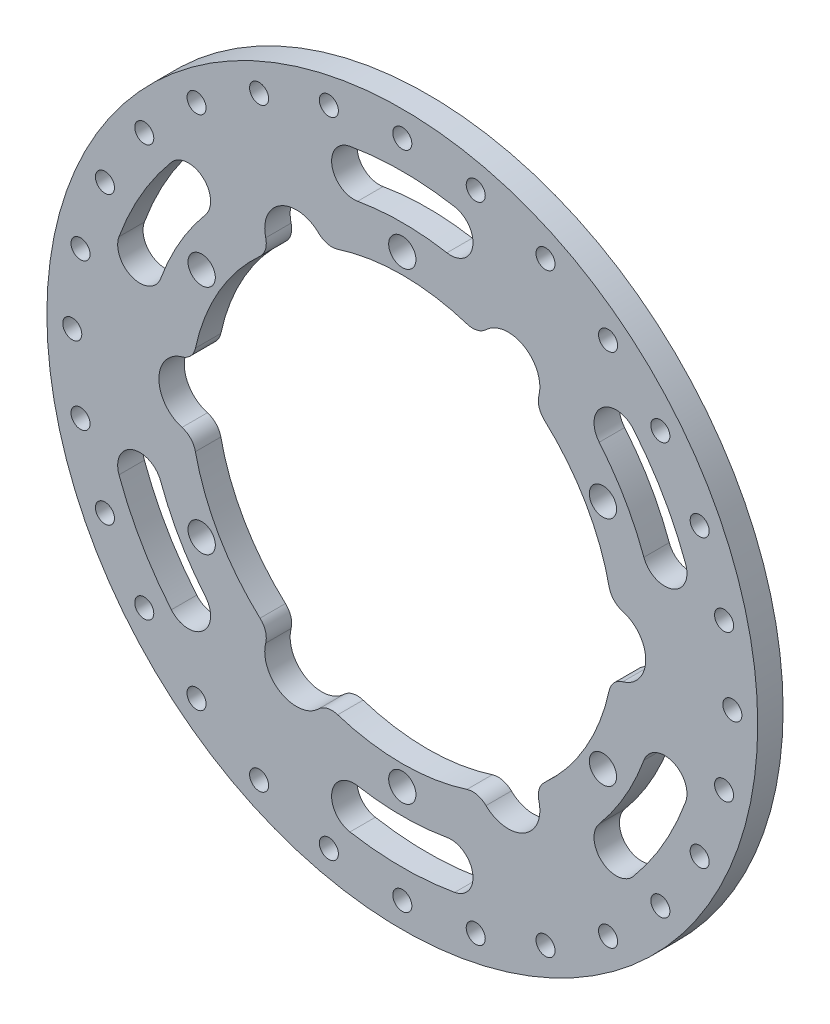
ISO-10303-21;
HEADER;
FILE_DESCRIPTION(('STEP AP214'),'2;1');
FILE_NAME('part.step','',(''),(''),'','','');
FILE_SCHEMA(('AUTOMOTIVE_DESIGN { 1 0 10303 214 1 1 1 1 }'));
ENDSEC;
DATA;
#1=APPLICATION_CONTEXT('core data for automotive mechanical design processes');
#2=APPLICATION_PROTOCOL_DEFINITION('international standard','automotive_design',2000,#1);
#3=PRODUCT_CONTEXT('',#1,'mechanical');
#4=PRODUCT('Part','Part','',(#3));
#5=PRODUCT_RELATED_PRODUCT_CATEGORY('part','',(#4));
#6=PRODUCT_DEFINITION_FORMATION('','',#4);
#7=PRODUCT_DEFINITION_CONTEXT('part definition',#1,'design');
#8=PRODUCT_DEFINITION('design','',#6,#7);
#9=PRODUCT_DEFINITION_SHAPE('','',#8);
#10=(LENGTH_UNIT() NAMED_UNIT(*) SI_UNIT(.MILLI.,.METRE.));
#11=(NAMED_UNIT(*) PLANE_ANGLE_UNIT() SI_UNIT($,.RADIAN.));
#12=(NAMED_UNIT(*) SI_UNIT($,.STERADIAN.) SOLID_ANGLE_UNIT());
#13=UNCERTAINTY_MEASURE_WITH_UNIT(LENGTH_MEASURE(1.E-05),#10,'distance_accuracy_value','');
#14=(GEOMETRIC_REPRESENTATION_CONTEXT(3) GLOBAL_UNCERTAINTY_ASSIGNED_CONTEXT((#13)) GLOBAL_UNIT_ASSIGNED_CONTEXT((#10,
#11,#12)) REPRESENTATION_CONTEXT('',''));
#15=CARTESIAN_POINT('',(0.,0.,0.));
#16=DIRECTION('',(0.,0.,1.));
#17=DIRECTION('',(1.,0.,0.));
#18=AXIS2_PLACEMENT_3D('',#15,#16,#17);
#19=CARTESIAN_POINT('',(-41.346475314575,-15.0488863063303,-6.));
#20=DIRECTION('',(0.,0.,1.));
#21=DIRECTION('',(1.,0.,0.));
#22=AXIS2_PLACEMENT_3D('',#19,#20,#21);
#23=CYLINDRICAL_SURFACE('',#22,3.5);
#24=DIRECTION('',(0.,0.,1.));
#25=VECTOR('',#24,1.);
#26=CARTESIAN_POINT('',(-38.0575511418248,-13.8518158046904,-6.));
#27=LINE('',#26,#25);
#28=CARTESIAN_POINT('',(-38.0575511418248,-13.8518158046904,0.));
#29=VERTEX_POINT('',#28);
#30=CARTESIAN_POINT('',(-38.0575511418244,-13.8518158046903,4.));
#31=VERTEX_POINT('',#30);
#32=EDGE_CURVE('E473',#29,#31,#27,.T.);
#33=ORIENTED_EDGE('',*,*,#32,.T.);
#34=CARTESIAN_POINT('',(-41.346475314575,-15.0488863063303,4.));
#35=DIRECTION('',(0.,0.,1.));
#36=DIRECTION('',(1.,0.,0.));
#37=AXIS2_PLACEMENT_3D('',#34,#35,#36);
#38=CIRCLE('',#37,3.5);
#39=CARTESIAN_POINT('',(-44.6353994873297,-16.2459568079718,4.));
#40=VERTEX_POINT('',#39);
#41=EDGE_CURVE('E522',#31,#40,#38,.T.);
#42=ORIENTED_EDGE('',*,*,#41,.T.);
#43=DIRECTION('',(0.,0.,1.));
#44=VECTOR('',#43,1.);
#45=CARTESIAN_POINT('',(-44.6353994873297,-16.2459568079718,-6.));
#46=LINE('',#45,#44);
#47=CARTESIAN_POINT('',(-44.6353994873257,-16.2459568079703,0.));
#48=VERTEX_POINT('',#47);
#49=EDGE_CURVE('E11',#48,#40,#46,.T.);
#50=ORIENTED_EDGE('',*,*,#49,.F.);
#51=CARTESIAN_POINT('',(-41.346475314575,-15.0488863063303,0.));
#52=DIRECTION('',(0.,0.,1.));
#53=DIRECTION('',(1.,0.,0.));
#54=AXIS2_PLACEMENT_3D('',#51,#52,#53);
#55=CIRCLE('',#54,3.5);
#56=EDGE_CURVE('E369',#29,#48,#55,.T.);
#57=ORIENTED_EDGE('',*,*,#56,.F.);
#58=EDGE_LOOP('',(#33,#42,#50,#57));
#59=FACE_BOUND('',#58,.T.);
#60=ADVANCED_FACE('F17',(#59),#23,.F.);
#61=CARTESIAN_POINT('',(0.,0.,-6.));
#62=DIRECTION('',(0.,0.,1.));
#63=DIRECTION('',(1.,0.,0.));
#64=AXIS2_PLACEMENT_3D('',#61,#62,#63);
#65=CYLINDRICAL_SURFACE('',#64,47.5);
#66=ORIENTED_EDGE('',*,*,#49,.T.);
#67=CARTESIAN_POINT('',(0.,0.,4.));
#68=DIRECTION('',(0.,0.,1.));
#69=DIRECTION('',(1.,0.,0.));
#70=AXIS2_PLACEMENT_3D('',#67,#68,#69);
#71=CIRCLE('',#70,47.5);
#72=CARTESIAN_POINT('',(-36.387111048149,-30.5324114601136,4.));
#73=VERTEX_POINT('',#72);
#74=EDGE_CURVE('E526',#40,#73,#71,.T.);
#75=ORIENTED_EDGE('',*,*,#74,.T.);
#76=DIRECTION('',(0.,0.,1.));
#77=VECTOR('',#76,1.);
#78=CARTESIAN_POINT('',(-36.387111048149,-30.5324114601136,-6.));
#79=LINE('',#78,#77);
#80=CARTESIAN_POINT('',(-36.387111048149,-30.5324114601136,0.));
#81=VERTEX_POINT('',#80);
#82=EDGE_CURVE('E25',#81,#73,#79,.T.);
#83=ORIENTED_EDGE('',*,*,#82,.F.);
#84=CARTESIAN_POINT('',(0.,0.,0.));
#85=DIRECTION('',(0.,0.,1.));
#86=DIRECTION('',(1.,0.,0.));
#87=AXIS2_PLACEMENT_3D('',#84,#85,#86);
#88=CIRCLE('',#87,47.5);
#89=EDGE_CURVE('E378',#48,#81,#88,.T.);
#90=ORIENTED_EDGE('',*,*,#89,.F.);
#91=EDGE_LOOP('',(#66,#75,#83,#90));
#92=FACE_BOUND('',#91,.T.);
#93=ADVANCED_FACE('F1442',(#92),#65,.F.);
#94=CARTESIAN_POINT('',(0.,0.,-6.));
#95=DIRECTION('',(0.,0.,1.));
#96=DIRECTION('',(1.,0.,0.));
#97=AXIS2_PLACEMENT_3D('',#94,#95,#96);
#98=CYLINDRICAL_SURFACE('',#97,40.5);
#99=CARTESIAN_POINT('',(0.,0.,0.));
#100=DIRECTION('',(0.,0.,1.));
#101=DIRECTION('',(1.,0.,0.));
#102=AXIS2_PLACEMENT_3D('',#99,#100,#101);
#103=CIRCLE('',#102,40.5);
#104=CARTESIAN_POINT('',(-31.0247999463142,-26.0328981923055,0.));
#105=VERTEX_POINT('',#104);
#106=EDGE_CURVE('E361',#29,#105,#103,.T.);
#107=ORIENTED_EDGE('',*,*,#106,.T.);
#108=DIRECTION('',(0.,0.,1.));
#109=VECTOR('',#108,1.);
#110=CARTESIAN_POINT('',(-31.0247999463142,-26.0328981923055,-6.));
#111=LINE('',#110,#109);
#112=CARTESIAN_POINT('',(-31.0247999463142,-26.0328981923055,4.));
#113=VERTEX_POINT('',#112);
#114=EDGE_CURVE('E1500',#105,#113,#111,.T.);
#115=ORIENTED_EDGE('',*,*,#114,.T.);
#116=CARTESIAN_POINT('',(0.,0.,4.));
#117=DIRECTION('',(0.,0.,1.));
#118=DIRECTION('',(1.,0.,0.));
#119=AXIS2_PLACEMENT_3D('',#116,#117,#118);
#120=CIRCLE('',#119,40.5);
#121=EDGE_CURVE('E525',#31,#113,#120,.T.);
#122=ORIENTED_EDGE('',*,*,#121,.F.);
#123=ORIENTED_EDGE('',*,*,#32,.F.);
#124=EDGE_LOOP('',(#107,#115,#122,#123));
#125=FACE_BOUND('',#124,.T.);
#126=ADVANCED_FACE('F1446',(#125),#98,.T.);
#127=CARTESIAN_POINT('',(-7.64051981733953,-43.3315411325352,-6.));
#128=DIRECTION('',(0.,0.,1.));
#129=DIRECTION('',(1.,0.,0.));
#130=AXIS2_PLACEMENT_3D('',#127,#128,#129);
#131=CYLINDRICAL_SURFACE('',#130,3.5);
#132=DIRECTION('',(0.,0.,1.));
#133=VECTOR('',#132,1.);
#134=CARTESIAN_POINT('',(-7.03275119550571,-39.8847139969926,-6.));
#135=LINE('',#134,#133);
#136=CARTESIAN_POINT('',(-7.03275119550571,-39.8847139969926,0.));
#137=VERTEX_POINT('',#136);
#138=CARTESIAN_POINT('',(-7.03275119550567,-39.8847139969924,4.));
#139=VERTEX_POINT('',#138);
#140=EDGE_CURVE('E465',#137,#139,#135,.T.);
#141=ORIENTED_EDGE('',*,*,#140,.T.);
#142=CARTESIAN_POINT('',(-7.64051981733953,-43.3315411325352,4.));
#143=DIRECTION('',(0.,0.,1.));
#144=DIRECTION('',(1.,0.,0.));
#145=AXIS2_PLACEMENT_3D('',#142,#143,#144);
#146=CIRCLE('',#145,3.5);
#147=CARTESIAN_POINT('',(-8.2482884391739,-46.7783682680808,4.));
#148=VERTEX_POINT('',#147);
#149=EDGE_CURVE('E507',#139,#148,#146,.T.);
#150=ORIENTED_EDGE('',*,*,#149,.T.);
#151=DIRECTION('',(0.,0.,1.));
#152=VECTOR('',#151,1.);
#153=CARTESIAN_POINT('',(-8.2482884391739,-46.7783682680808,-6.));
#154=LINE('',#153,#152);
#155=CARTESIAN_POINT('',(-8.2482884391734,-46.778368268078,0.));
#156=VERTEX_POINT('',#155);
#157=EDGE_CURVE('E471',#156,#148,#154,.T.);
#158=ORIENTED_EDGE('',*,*,#157,.F.);
#159=CARTESIAN_POINT('',(-7.64051981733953,-43.3315411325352,0.));
#160=DIRECTION('',(0.,0.,1.));
#161=DIRECTION('',(1.,0.,0.));
#162=AXIS2_PLACEMENT_3D('',#159,#160,#161);
#163=CIRCLE('',#162,3.5);
#164=EDGE_CURVE('E534',#137,#156,#163,.T.);
#165=ORIENTED_EDGE('',*,*,#164,.F.);
#166=EDGE_LOOP('',(#141,#150,#158,#165));
#167=FACE_BOUND('',#166,.T.);
#168=ADVANCED_FACE('F1452',(#167),#131,.F.);
#169=CARTESIAN_POINT('',(0.,0.,-6.));
#170=DIRECTION('',(0.,0.,1.));
#171=DIRECTION('',(1.,0.,0.));
#172=AXIS2_PLACEMENT_3D('',#169,#170,#171);
#173=CYLINDRICAL_SURFACE('',#172,47.5);
#174=ORIENTED_EDGE('',*,*,#157,.T.);
#175=CARTESIAN_POINT('',(0.,0.,4.));
#176=DIRECTION('',(0.,0.,1.));
#177=DIRECTION('',(1.,0.,0.));
#178=AXIS2_PLACEMENT_3D('',#175,#176,#177);
#179=CIRCLE('',#178,47.5);
#180=CARTESIAN_POINT('',(8.24828843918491,-46.7783682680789,4.));
#181=VERTEX_POINT('',#180);
#182=EDGE_CURVE('E515',#148,#181,#179,.T.);
#183=ORIENTED_EDGE('',*,*,#182,.T.);
#184=DIRECTION('',(0.,0.,1.));
#185=VECTOR('',#184,1.);
#186=CARTESIAN_POINT('',(8.24828843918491,-46.7783682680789,-6.));
#187=LINE('',#186,#185);
#188=CARTESIAN_POINT('',(8.24828843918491,-46.7783682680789,0.));
#189=VERTEX_POINT('',#188);
#190=EDGE_CURVE('E468',#189,#181,#187,.T.);
#191=ORIENTED_EDGE('',*,*,#190,.F.);
#192=CARTESIAN_POINT('',(0.,0.,0.));
#193=DIRECTION('',(0.,0.,1.));
#194=DIRECTION('',(1.,0.,0.));
#195=AXIS2_PLACEMENT_3D('',#192,#193,#194);
#196=CIRCLE('',#195,47.5);
#197=EDGE_CURVE('E535',#156,#189,#196,.T.);
#198=ORIENTED_EDGE('',*,*,#197,.F.);
#199=EDGE_LOOP('',(#174,#183,#191,#198));
#200=FACE_BOUND('',#199,.T.);
#201=ADVANCED_FACE('F1457',(#200),#173,.F.);
#202=CARTESIAN_POINT('',(0.,0.,-6.));
#203=DIRECTION('',(0.,0.,1.));
#204=DIRECTION('',(1.,0.,0.));
#205=AXIS2_PLACEMENT_3D('',#202,#203,#204);
#206=CYLINDRICAL_SURFACE('',#205,40.5);
#207=CARTESIAN_POINT('',(0.,0.,0.));
#208=DIRECTION('',(0.,0.,1.));
#209=DIRECTION('',(1.,0.,0.));
#210=AXIS2_PLACEMENT_3D('',#207,#208,#209);
#211=CIRCLE('',#210,40.5);
#212=CARTESIAN_POINT('',(7.0327511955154,-39.8847139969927,0.));
#213=VERTEX_POINT('',#212);
#214=EDGE_CURVE('E530',#137,#213,#211,.T.);
#215=ORIENTED_EDGE('',*,*,#214,.T.);
#216=DIRECTION('',(0.,0.,1.));
#217=VECTOR('',#216,1.);
#218=CARTESIAN_POINT('',(7.0327511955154,-39.8847139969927,-6.));
#219=LINE('',#218,#217);
#220=CARTESIAN_POINT('',(7.0327511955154,-39.8847139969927,4.));
#221=VERTEX_POINT('',#220);
#222=EDGE_CURVE('E343',#213,#221,#219,.T.);
#223=ORIENTED_EDGE('',*,*,#222,.T.);
#224=CARTESIAN_POINT('',(0.,0.,4.));
#225=DIRECTION('',(0.,0.,1.));
#226=DIRECTION('',(1.,0.,0.));
#227=AXIS2_PLACEMENT_3D('',#224,#225,#226);
#228=CIRCLE('',#227,40.5);
#229=EDGE_CURVE('E511',#139,#221,#228,.T.);
#230=ORIENTED_EDGE('',*,*,#229,.F.);
#231=ORIENTED_EDGE('',*,*,#140,.F.);
#232=EDGE_LOOP('',(#215,#223,#230,#231));
#233=FACE_BOUND('',#232,.T.);
#234=ADVANCED_FACE('F1473',(#233),#206,.T.);
#235=CARTESIAN_POINT('',(33.7059554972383,-28.2826548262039,-6.));
#236=DIRECTION('',(0.,0.,1.));
#237=DIRECTION('',(1.,0.,0.));
#238=AXIS2_PLACEMENT_3D('',#235,#236,#237);
#239=CYLINDRICAL_SURFACE('',#238,3.5);
#240=DIRECTION('',(0.,0.,1.));
#241=VECTOR('',#240,1.);
#242=CARTESIAN_POINT('',(31.0247999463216,-26.0328981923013,-6.));
#243=LINE('',#242,#241);
#244=CARTESIAN_POINT('',(31.0247999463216,-26.0328981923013,0.));
#245=VERTEX_POINT('',#244);
#246=CARTESIAN_POINT('',(31.0247999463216,-26.0328981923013,4.));
#247=VERTEX_POINT('',#246);
#248=EDGE_CURVE('E354',#245,#247,#243,.T.);
#249=ORIENTED_EDGE('',*,*,#248,.T.);
#250=CARTESIAN_POINT('',(33.7059554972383,-28.2826548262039,4.));
#251=DIRECTION('',(0.,0.,1.));
#252=DIRECTION('',(1.,0.,0.));
#253=AXIS2_PLACEMENT_3D('',#250,#251,#252);
#254=CIRCLE('',#253,3.5);
#255=CARTESIAN_POINT('',(36.3871110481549,-30.5324114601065,4.));
#256=VERTEX_POINT('',#255);
#257=EDGE_CURVE('E499',#247,#256,#254,.T.);
#258=ORIENTED_EDGE('',*,*,#257,.T.);
#259=DIRECTION('',(0.,0.,1.));
#260=VECTOR('',#259,1.);
#261=CARTESIAN_POINT('',(36.3871110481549,-30.5324114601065,-6.));
#262=LINE('',#261,#260);
#263=CARTESIAN_POINT('',(36.3871110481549,-30.5324114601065,0.));
#264=VERTEX_POINT('',#263);
#265=EDGE_CURVE('E353',#264,#256,#262,.T.);
#266=ORIENTED_EDGE('',*,*,#265,.F.);
#267=CARTESIAN_POINT('',(33.7059554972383,-28.2826548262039,0.));
#268=DIRECTION('',(0.,0.,1.));
#269=DIRECTION('',(1.,0.,0.));
#270=AXIS2_PLACEMENT_3D('',#267,#268,#269);
#271=CIRCLE('',#270,3.5);
#272=EDGE_CURVE('E359',#245,#264,#271,.T.);
#273=ORIENTED_EDGE('',*,*,#272,.F.);
#274=EDGE_LOOP('',(#249,#258,#266,#273));
#275=FACE_BOUND('',#274,.T.);
#276=ADVANCED_FACE('F1340',(#275),#239,.F.);
#277=CARTESIAN_POINT('',(0.,0.,-6.));
#278=DIRECTION('',(0.,0.,1.));
#279=DIRECTION('',(1.,0.,0.));
#280=AXIS2_PLACEMENT_3D('',#277,#278,#279);
#281=CYLINDRICAL_SURFACE('',#280,47.5);
#282=ORIENTED_EDGE('',*,*,#265,.T.);
#283=CARTESIAN_POINT('',(0.,0.,4.));
#284=DIRECTION('',(0.,0.,1.));
#285=DIRECTION('',(1.,0.,0.));
#286=AXIS2_PLACEMENT_3D('',#283,#284,#285);
#287=CIRCLE('',#286,47.5);
#288=CARTESIAN_POINT('',(44.6353994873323,-16.2459568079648,4.));
#289=VERTEX_POINT('',#288);
#290=EDGE_CURVE('E351',#256,#289,#287,.T.);
#291=ORIENTED_EDGE('',*,*,#290,.T.);
#292=DIRECTION('',(0.,0.,1.));
#293=VECTOR('',#292,1.);
#294=CARTESIAN_POINT('',(44.6353994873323,-16.2459568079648,-6.));
#295=LINE('',#294,#293);
#296=CARTESIAN_POINT('',(44.6353994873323,-16.2459568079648,0.));
#297=VERTEX_POINT('',#296);
#298=EDGE_CURVE('E333',#297,#289,#295,.T.);
#299=ORIENTED_EDGE('',*,*,#298,.F.);
#300=CARTESIAN_POINT('',(0.,0.,0.));
#301=DIRECTION('',(0.,0.,1.));
#302=DIRECTION('',(1.,0.,0.));
#303=AXIS2_PLACEMENT_3D('',#300,#301,#302);
#304=CIRCLE('',#303,47.5);
#305=EDGE_CURVE('E348',#264,#297,#304,.T.);
#306=ORIENTED_EDGE('',*,*,#305,.F.);
#307=EDGE_LOOP('',(#282,#291,#299,#306));
#308=FACE_BOUND('',#307,.T.);
#309=ADVANCED_FACE('F347',(#308),#281,.F.);
#310=CARTESIAN_POINT('',(0.,0.,-6.));
#311=DIRECTION('',(0.,0.,1.));
#312=DIRECTION('',(1.,0.,0.));
#313=AXIS2_PLACEMENT_3D('',#310,#311,#312);
#314=CYLINDRICAL_SURFACE('',#313,40.5);
#315=CARTESIAN_POINT('',(0.,0.,0.));
#316=DIRECTION('',(0.,0.,1.));
#317=DIRECTION('',(1.,0.,0.));
#318=AXIS2_PLACEMENT_3D('',#315,#316,#317);
#319=CIRCLE('',#318,40.5);
#320=CARTESIAN_POINT('',(38.0575511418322,-13.8518158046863,0.));
#321=VERTEX_POINT('',#320);
#322=EDGE_CURVE('E371',#245,#321,#319,.T.);
#323=ORIENTED_EDGE('',*,*,#322,.T.);
#324=DIRECTION('',(0.,0.,1.));
#325=VECTOR('',#324,1.);
#326=CARTESIAN_POINT('',(38.0575511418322,-13.8518158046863,-6.));
#327=LINE('',#326,#325);
#328=CARTESIAN_POINT('',(38.0575511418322,-13.8518158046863,4.));
#329=VERTEX_POINT('',#328);
#330=EDGE_CURVE('E337',#321,#329,#327,.T.);
#331=ORIENTED_EDGE('',*,*,#330,.T.);
#332=CARTESIAN_POINT('',(0.,0.,4.));
#333=DIRECTION('',(0.,0.,1.));
#334=DIRECTION('',(1.,0.,0.));
#335=AXIS2_PLACEMENT_3D('',#332,#333,#334);
#336=CIRCLE('',#335,40.5);
#337=EDGE_CURVE('E503',#247,#329,#336,.T.);
#338=ORIENTED_EDGE('',*,*,#337,.F.);
#339=ORIENTED_EDGE('',*,*,#248,.F.);
#340=EDGE_LOOP('',(#323,#331,#338,#339));
#341=FACE_BOUND('',#340,.T.);
#342=ADVANCED_FACE('F1336',(#341),#314,.T.);
#343=CARTESIAN_POINT('',(0.,0.,-6.));
#344=DIRECTION('',(0.,0.,1.));
#345=DIRECTION('',(1.,0.,0.));
#346=AXIS2_PLACEMENT_3D('',#343,#344,#345);
#347=CYLINDRICAL_SURFACE('',#346,47.5);
#348=DIRECTION('',(0.,0.,1.));
#349=VECTOR('',#348,1.);
#350=CARTESIAN_POINT('',(44.6353994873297,16.2459568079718,-6.));
#351=LINE('',#350,#349);
#352=CARTESIAN_POINT('',(44.6353994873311,16.2459568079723,0.));
#353=VERTEX_POINT('',#352);
#354=CARTESIAN_POINT('',(44.6353994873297,16.2459568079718,4.));
#355=VERTEX_POINT('',#354);
#356=EDGE_CURVE('E1144',#353,#355,#351,.T.);
#357=ORIENTED_EDGE('',*,*,#356,.T.);
#358=CARTESIAN_POINT('',(0.,0.,4.));
#359=DIRECTION('',(0.,0.,1.));
#360=DIRECTION('',(1.,0.,0.));
#361=AXIS2_PLACEMENT_3D('',#358,#359,#360);
#362=CIRCLE('',#361,47.5);
#363=CARTESIAN_POINT('',(36.3871110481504,30.5324114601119,4.));
#364=VERTEX_POINT('',#363);
#365=EDGE_CURVE('E495',#355,#364,#362,.T.);
#366=ORIENTED_EDGE('',*,*,#365,.T.);
#367=DIRECTION('',(0.,0.,1.));
#368=VECTOR('',#367,1.);
#369=CARTESIAN_POINT('',(36.3871110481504,30.5324114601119,-6.));
#370=LINE('',#369,#368);
#371=CARTESIAN_POINT('',(36.3871110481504,30.5324114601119,0.));
#372=VERTEX_POINT('',#371);
#373=EDGE_CURVE('E458',#372,#364,#370,.T.);
#374=ORIENTED_EDGE('',*,*,#373,.F.);
#375=CARTESIAN_POINT('',(0.,0.,0.));
#376=DIRECTION('',(0.,0.,1.));
#377=DIRECTION('',(1.,0.,0.));
#378=AXIS2_PLACEMENT_3D('',#375,#376,#377);
#379=CIRCLE('',#378,47.5);
#380=EDGE_CURVE('E543',#353,#372,#379,.T.);
#381=ORIENTED_EDGE('',*,*,#380,.F.);
#382=EDGE_LOOP('',(#357,#366,#374,#381));
#383=FACE_BOUND('',#382,.T.);
#384=ADVANCED_FACE('F1142',(#383),#347,.F.);
#385=CARTESIAN_POINT('',(33.7059554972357,28.2826548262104,-6.));
#386=DIRECTION('',(0.,0.,1.));
#387=DIRECTION('',(1.,0.,0.));
#388=AXIS2_PLACEMENT_3D('',#385,#386,#387);
#389=CYLINDRICAL_SURFACE('',#388,3.5);
#390=ORIENTED_EDGE('',*,*,#373,.T.);
#391=CARTESIAN_POINT('',(33.7059554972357,28.2826548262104,4.));
#392=DIRECTION('',(0.,0.,1.));
#393=DIRECTION('',(1.,0.,0.));
#394=AXIS2_PLACEMENT_3D('',#391,#392,#393);
#395=CIRCLE('',#394,3.5);
#396=CARTESIAN_POINT('',(31.0247999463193,26.0328981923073,4.));
#397=VERTEX_POINT('',#396);
#398=EDGE_CURVE('E491',#364,#397,#395,.T.);
#399=ORIENTED_EDGE('',*,*,#398,.T.);
#400=DIRECTION('',(0.,0.,1.));
#401=VECTOR('',#400,1.);
#402=CARTESIAN_POINT('',(31.0247999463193,26.0328981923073,-6.));
#403=LINE('',#402,#401);
#404=CARTESIAN_POINT('',(31.0247999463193,26.0328981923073,0.));
#405=VERTEX_POINT('',#404);
#406=EDGE_CURVE('E451',#405,#397,#403,.T.);
#407=ORIENTED_EDGE('',*,*,#406,.F.);
#408=CARTESIAN_POINT('',(33.7059554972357,28.2826548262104,0.));
#409=DIRECTION('',(0.,0.,1.));
#410=DIRECTION('',(1.,0.,0.));
#411=AXIS2_PLACEMENT_3D('',#408,#409,#410);
#412=CIRCLE('',#411,3.5);
#413=EDGE_CURVE('E547',#372,#405,#412,.T.);
#414=ORIENTED_EDGE('',*,*,#413,.F.);
#415=EDGE_LOOP('',(#390,#399,#407,#414));
#416=FACE_BOUND('',#415,.T.);
#417=ADVANCED_FACE('F1138',(#416),#389,.F.);
#418=CARTESIAN_POINT('',(0.,0.,-6.));
#419=DIRECTION('',(0.,0.,1.));
#420=DIRECTION('',(1.,0.,0.));
#421=AXIS2_PLACEMENT_3D('',#418,#419,#420);
#422=CYLINDRICAL_SURFACE('',#421,40.5);
#423=CARTESIAN_POINT('',(0.,0.,0.));
#424=DIRECTION('',(0.,0.,1.));
#425=DIRECTION('',(1.,0.,0.));
#426=AXIS2_PLACEMENT_3D('',#423,#424,#425);
#427=CIRCLE('',#426,40.5);
#428=CARTESIAN_POINT('',(38.0575511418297,13.8518158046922,0.));
#429=VERTEX_POINT('',#428);
#430=EDGE_CURVE('E539',#429,#405,#427,.T.);
#431=ORIENTED_EDGE('',*,*,#430,.T.);
#432=ORIENTED_EDGE('',*,*,#406,.T.);
#433=CARTESIAN_POINT('',(0.,0.,4.));
#434=DIRECTION('',(0.,0.,1.));
#435=DIRECTION('',(1.,0.,0.));
#436=AXIS2_PLACEMENT_3D('',#433,#434,#435);
#437=CIRCLE('',#436,40.5);
#438=CARTESIAN_POINT('',(38.0575511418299,13.8518158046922,4.));
#439=VERTEX_POINT('',#438);
#440=EDGE_CURVE('E489',#439,#397,#437,.T.);
#441=ORIENTED_EDGE('',*,*,#440,.F.);
#442=DIRECTION('',(0.,0.,1.));
#443=VECTOR('',#442,1.);
#444=CARTESIAN_POINT('',(38.0575511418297,13.8518158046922,-6.));
#445=LINE('',#444,#443);
#446=EDGE_CURVE('E454',#429,#439,#445,.T.);
#447=ORIENTED_EDGE('',*,*,#446,.F.);
#448=EDGE_LOOP('',(#431,#432,#441,#447));
#449=FACE_BOUND('',#448,.T.);
#450=ADVANCED_FACE('F1134',(#449),#422,.T.);
#451=CARTESIAN_POINT('',(0.,0.,-6.));
#452=DIRECTION('',(0.,0.,1.));
#453=DIRECTION('',(1.,0.,0.));
#454=AXIS2_PLACEMENT_3D('',#451,#452,#453);
#455=CYLINDRICAL_SURFACE('',#454,47.5);
#456=DIRECTION('',(0.,0.,1.));
#457=VECTOR('',#456,1.);
#458=CARTESIAN_POINT('',(8.24828843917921,46.7783682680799,-6.));
#459=LINE('',#458,#457);
#460=CARTESIAN_POINT('',(8.24828843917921,46.7783682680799,0.));
#461=VERTEX_POINT('',#460);
#462=CARTESIAN_POINT('',(8.24828843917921,46.7783682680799,4.));
#463=VERTEX_POINT('',#462);
#464=EDGE_CURVE('E652',#461,#463,#459,.T.);
#465=ORIENTED_EDGE('',*,*,#464,.T.);
#466=CARTESIAN_POINT('',(0.,0.,4.));
#467=DIRECTION('',(0.,0.,1.));
#468=DIRECTION('',(1.,0.,0.));
#469=AXIS2_PLACEMENT_3D('',#466,#467,#468);
#470=CIRCLE('',#469,47.5);
#471=CARTESIAN_POINT('',(-8.24828843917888,46.7783682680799,4.));
#472=VERTEX_POINT('',#471);
#473=EDGE_CURVE('E765',#463,#472,#470,.T.);
#474=ORIENTED_EDGE('',*,*,#473,.T.);
#475=DIRECTION('',(0.,0.,1.));
#476=VECTOR('',#475,1.);
#477=CARTESIAN_POINT('',(-8.24828843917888,46.7783682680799,-6.));
#478=LINE('',#477,#476);
#479=CARTESIAN_POINT('',(-8.24828843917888,46.7783682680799,0.));
#480=VERTEX_POINT('',#479);
#481=EDGE_CURVE('E448',#480,#472,#478,.T.);
#482=ORIENTED_EDGE('',*,*,#481,.F.);
#483=CARTESIAN_POINT('',(0.,0.,0.));
#484=DIRECTION('',(0.,0.,1.));
#485=DIRECTION('',(1.,0.,0.));
#486=AXIS2_PLACEMENT_3D('',#483,#484,#485);
#487=CIRCLE('',#486,47.5);
#488=EDGE_CURVE('E564',#461,#480,#487,.T.);
#489=ORIENTED_EDGE('',*,*,#488,.F.);
#490=EDGE_LOOP('',(#465,#474,#482,#489));
#491=FACE_BOUND('',#490,.T.);
#492=ADVANCED_FACE('F649',(#491),#455,.F.);
#493=CARTESIAN_POINT('',(-7.64051981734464,43.3315411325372,-6.));
#494=DIRECTION('',(0.,0.,1.));
#495=DIRECTION('',(1.,0.,0.));
#496=AXIS2_PLACEMENT_3D('',#493,#494,#495);
#497=CYLINDRICAL_SURFACE('',#496,3.5);
#498=ORIENTED_EDGE('',*,*,#481,.T.);
#499=CARTESIAN_POINT('',(-7.64051981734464,43.3315411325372,4.));
#500=DIRECTION('',(0.,0.,1.));
#501=DIRECTION('',(1.,0.,0.));
#502=AXIS2_PLACEMENT_3D('',#499,#500,#501);
#503=CIRCLE('',#502,3.5);
#504=CARTESIAN_POINT('',(-7.03275119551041,39.8847139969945,4.));
#505=VERTEX_POINT('',#504);
#506=EDGE_CURVE('E761',#472,#505,#503,.T.);
#507=ORIENTED_EDGE('',*,*,#506,.T.);
#508=DIRECTION('',(0.,0.,1.));
#509=VECTOR('',#508,1.);
#510=CARTESIAN_POINT('',(-7.03275119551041,39.8847139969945,-6.));
#511=LINE('',#510,#509);
#512=CARTESIAN_POINT('',(-7.03275119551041,39.8847139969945,0.));
#513=VERTEX_POINT('',#512);
#514=EDGE_CURVE('E444',#513,#505,#511,.T.);
#515=ORIENTED_EDGE('',*,*,#514,.F.);
#516=CARTESIAN_POINT('',(-7.64051981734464,43.3315411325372,0.));
#517=DIRECTION('',(0.,0.,1.));
#518=DIRECTION('',(1.,0.,0.));
#519=AXIS2_PLACEMENT_3D('',#516,#517,#518);
#520=CIRCLE('',#519,3.5);
#521=EDGE_CURVE('E560',#480,#513,#520,.T.);
#522=ORIENTED_EDGE('',*,*,#521,.F.);
#523=EDGE_LOOP('',(#498,#507,#515,#522));
#524=FACE_BOUND('',#523,.T.);
#525=ADVANCED_FACE('F1467',(#524),#497,.F.);
#526=CARTESIAN_POINT('',(0.,0.,-6.));
#527=DIRECTION('',(0.,0.,1.));
#528=DIRECTION('',(1.,0.,0.));
#529=AXIS2_PLACEMENT_3D('',#526,#527,#528);
#530=CYLINDRICAL_SURFACE('',#529,40.5);
#531=CARTESIAN_POINT('',(0.,0.,0.));
#532=DIRECTION('',(0.,0.,1.));
#533=DIRECTION('',(1.,0.,0.));
#534=AXIS2_PLACEMENT_3D('',#531,#532,#533);
#535=CIRCLE('',#534,40.5);
#536=CARTESIAN_POINT('',(7.0327511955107,39.8847139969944,0.));
#537=VERTEX_POINT('',#536);
#538=EDGE_CURVE('E520',#537,#513,#535,.T.);
#539=ORIENTED_EDGE('',*,*,#538,.T.);
#540=ORIENTED_EDGE('',*,*,#514,.T.);
#541=CARTESIAN_POINT('',(0.,0.,4.));
#542=DIRECTION('',(0.,0.,1.));
#543=DIRECTION('',(1.,0.,0.));
#544=AXIS2_PLACEMENT_3D('',#541,#542,#543);
#545=CIRCLE('',#544,40.5);
#546=CARTESIAN_POINT('',(7.0327511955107,39.8847139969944,4.));
#547=VERTEX_POINT('',#546);
#548=EDGE_CURVE('E766',#547,#505,#545,.T.);
#549=ORIENTED_EDGE('',*,*,#548,.F.);
#550=DIRECTION('',(0.,0.,1.));
#551=VECTOR('',#550,1.);
#552=CARTESIAN_POINT('',(7.0327511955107,39.8847139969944,-6.));
#553=LINE('',#552,#551);
#554=EDGE_CURVE('E447',#537,#547,#553,.T.);
#555=ORIENTED_EDGE('',*,*,#554,.F.);
#556=EDGE_LOOP('',(#539,#540,#549,#555));
#557=FACE_BOUND('',#556,.T.);
#558=ADVANCED_FACE('F1463',(#557),#530,.T.);
#559=CARTESIAN_POINT('',(0.,0.,-6.));
#560=DIRECTION('',(0.,0.,1.));
#561=DIRECTION('',(1.,0.,0.));
#562=AXIS2_PLACEMENT_3D('',#559,#560,#561);
#563=CYLINDRICAL_SURFACE('',#562,47.5);
#564=DIRECTION('',(0.,0.,1.));
#565=VECTOR('',#564,1.);
#566=CARTESIAN_POINT('',(-36.3871110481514,30.5324114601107,-6.));
#567=LINE('',#566,#565);
#568=CARTESIAN_POINT('',(-36.3871110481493,30.5324114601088,0.));
#569=VERTEX_POINT('',#568);
#570=CARTESIAN_POINT('',(-36.3871110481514,30.5324114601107,4.));
#571=VERTEX_POINT('',#570);
#572=EDGE_CURVE('E707',#569,#571,#567,.T.);
#573=ORIENTED_EDGE('',*,*,#572,.T.);
#574=CARTESIAN_POINT('',(0.,0.,4.));
#575=DIRECTION('',(0.,0.,1.));
#576=DIRECTION('',(1.,0.,0.));
#577=AXIS2_PLACEMENT_3D('',#574,#575,#576);
#578=CIRCLE('',#577,47.5);
#579=CARTESIAN_POINT('',(-44.6353994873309,16.2459568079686,4.));
#580=VERTEX_POINT('',#579);
#581=EDGE_CURVE('E998',#571,#580,#578,.T.);
#582=ORIENTED_EDGE('',*,*,#581,.T.);
#583=DIRECTION('',(0.,0.,1.));
#584=VECTOR('',#583,1.);
#585=CARTESIAN_POINT('',(-44.6353994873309,16.2459568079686,-6.));
#586=LINE('',#585,#584);
#587=CARTESIAN_POINT('',(-44.6353994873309,16.2459568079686,0.));
#588=VERTEX_POINT('',#587);
#589=EDGE_CURVE('E440',#588,#580,#586,.T.);
#590=ORIENTED_EDGE('',*,*,#589,.F.);
#591=CARTESIAN_POINT('',(0.,0.,0.));
#592=DIRECTION('',(0.,0.,1.));
#593=DIRECTION('',(1.,0.,0.));
#594=AXIS2_PLACEMENT_3D('',#591,#592,#593);
#595=CIRCLE('',#594,47.5);
#596=EDGE_CURVE('E555',#569,#588,#595,.T.);
#597=ORIENTED_EDGE('',*,*,#596,.F.);
#598=EDGE_LOOP('',(#573,#582,#590,#597));
#599=FACE_BOUND('',#598,.T.);
#600=ADVANCED_FACE('F1459',(#599),#563,.F.);
#601=CARTESIAN_POINT('',(-41.3464753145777,15.0488863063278,-6.));
#602=DIRECTION('',(0.,0.,1.));
#603=DIRECTION('',(1.,0.,0.));
#604=AXIS2_PLACEMENT_3D('',#601,#602,#603);
#605=CYLINDRICAL_SURFACE('',#604,3.5);
#606=ORIENTED_EDGE('',*,*,#589,.T.);
#607=CARTESIAN_POINT('',(-41.3464753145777,15.0488863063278,4.));
#608=DIRECTION('',(0.,0.,1.));
#609=DIRECTION('',(1.,0.,0.));
#610=AXIS2_PLACEMENT_3D('',#607,#608,#609);
#611=CIRCLE('',#610,3.5);
#612=CARTESIAN_POINT('',(-38.0575511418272,13.8518158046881,4.));
#613=VERTEX_POINT('',#612);
#614=EDGE_CURVE('E994',#580,#613,#611,.T.);
#615=ORIENTED_EDGE('',*,*,#614,.T.);
#616=DIRECTION('',(0.,0.,1.));
#617=VECTOR('',#616,1.);
#618=CARTESIAN_POINT('',(-38.0575511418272,13.8518158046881,-6.));
#619=LINE('',#618,#617);
#620=CARTESIAN_POINT('',(-38.0575511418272,13.8518158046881,0.));
#621=VERTEX_POINT('',#620);
#622=EDGE_CURVE('E441',#621,#613,#619,.T.);
#623=ORIENTED_EDGE('',*,*,#622,.F.);
#624=CARTESIAN_POINT('',(-41.3464753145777,15.0488863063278,0.));
#625=DIRECTION('',(0.,0.,1.));
#626=DIRECTION('',(1.,0.,0.));
#627=AXIS2_PLACEMENT_3D('',#624,#625,#626);
#628=CIRCLE('',#627,3.5);
#629=EDGE_CURVE('E559',#588,#621,#628,.T.);
#630=ORIENTED_EDGE('',*,*,#629,.F.);
#631=EDGE_LOOP('',(#606,#615,#623,#630));
#632=FACE_BOUND('',#631,.T.);
#633=ADVANCED_FACE('F1462',(#632),#605,.F.);
#634=CARTESIAN_POINT('',(0.,0.,-6.));
#635=DIRECTION('',(0.,0.,1.));
#636=DIRECTION('',(1.,0.,0.));
#637=AXIS2_PLACEMENT_3D('',#634,#635,#636);
#638=CYLINDRICAL_SURFACE('',#637,40.5);
#639=CARTESIAN_POINT('',(0.,0.,0.));
#640=DIRECTION('',(0.,0.,1.));
#641=DIRECTION('',(1.,0.,0.));
#642=AXIS2_PLACEMENT_3D('',#639,#640,#641);
#643=CIRCLE('',#642,40.5);
#644=CARTESIAN_POINT('',(-31.0247999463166,26.0328981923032,0.));
#645=VERTEX_POINT('',#644);
#646=EDGE_CURVE('E551',#645,#621,#643,.T.);
#647=ORIENTED_EDGE('',*,*,#646,.T.);
#648=ORIENTED_EDGE('',*,*,#622,.T.);
#649=CARTESIAN_POINT('',(0.,0.,4.));
#650=DIRECTION('',(0.,0.,1.));
#651=DIRECTION('',(1.,0.,0.));
#652=AXIS2_PLACEMENT_3D('',#649,#650,#651);
#653=CIRCLE('',#652,40.5);
#654=CARTESIAN_POINT('',(-31.0247999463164,26.032898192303,4.));
#655=VERTEX_POINT('',#654);
#656=EDGE_CURVE('E999',#655,#613,#653,.T.);
#657=ORIENTED_EDGE('',*,*,#656,.F.);
#658=DIRECTION('',(0.,0.,1.));
#659=VECTOR('',#658,1.);
#660=CARTESIAN_POINT('',(-31.0247999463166,26.0328981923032,-6.));
#661=LINE('',#660,#659);
#662=EDGE_CURVE('E436',#645,#655,#661,.T.);
#663=ORIENTED_EDGE('',*,*,#662,.F.);
#664=EDGE_LOOP('',(#647,#648,#657,#663));
#665=FACE_BOUND('',#664,.T.);
#666=ADVANCED_FACE('F3567',(#665),#638,.T.);
#667=CARTESIAN_POINT('',(-11.0955713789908,34.615181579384,0.));
#668=DIRECTION('',(0.,0.,1.));
#669=DIRECTION('',(1.,0.,0.));
#670=AXIS2_PLACEMENT_3D('',#667,#668,#669);
#671=CYLINDRICAL_SURFACE('',#670,3.);
#672=CARTESIAN_POINT('',(-11.0955713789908,34.615181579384,0.));
#673=DIRECTION('',(0.,0.,-1.));
#674=DIRECTION('',(1.,0.,0.));
#675=AXIS2_PLACEMENT_3D('',#672,#673,#674);
#676=CIRCLE('',#675,3.);
#677=CARTESIAN_POINT('',(-10.1798433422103,31.7583577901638,0.));
#678=VERTEX_POINT('',#677);
#679=CARTESIAN_POINT('',(-13.1878571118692,32.4652186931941,0.));
#680=VERTEX_POINT('',#679);
#681=EDGE_CURVE('E521',#678,#680,#676,.T.);
#682=ORIENTED_EDGE('',*,*,#681,.F.);
#683=DIRECTION('',(0.,0.,-1.));
#684=VECTOR('',#683,1.);
#685=CARTESIAN_POINT('',(-10.1798433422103,31.7583577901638,0.));
#686=LINE('',#685,#684);
#687=CARTESIAN_POINT('',(-10.1798433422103,31.7583577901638,4.));
#688=VERTEX_POINT('',#687);
#689=EDGE_CURVE('E393',#688,#678,#686,.T.);
#690=ORIENTED_EDGE('',*,*,#689,.F.);
#691=CARTESIAN_POINT('',(-11.0955713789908,34.615181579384,4.));
#692=DIRECTION('',(0.,0.,1.));
#693=DIRECTION('',(1.,0.,0.));
#694=AXIS2_PLACEMENT_3D('',#691,#692,#693);
#695=CIRCLE('',#694,3.);
#696=CARTESIAN_POINT('',(-13.1878571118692,32.4652186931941,4.));
#697=VERTEX_POINT('',#696);
#698=EDGE_CURVE('E1067',#697,#688,#695,.T.);
#699=ORIENTED_EDGE('',*,*,#698,.F.);
#700=DIRECTION('',(0.,0.,1.));
#701=VECTOR('',#700,1.);
#702=CARTESIAN_POINT('',(-13.1878571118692,32.4652186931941,0.));
#703=LINE('',#702,#701);
#704=EDGE_CURVE('E389',#680,#697,#703,.T.);
#705=ORIENTED_EDGE('',*,*,#704,.F.);
#706=EDGE_LOOP('',(#682,#690,#699,#705));
#707=FACE_BOUND('',#706,.T.);
#708=ADVANCED_FACE('F1303',(#707),#671,.T.);
#709=CARTESIAN_POINT('',(11.0955713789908,34.615181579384,0.));
#710=DIRECTION('',(0.,0.,1.));
#711=DIRECTION('',(1.,0.,0.));
#712=AXIS2_PLACEMENT_3D('',#709,#710,#711);
#713=CYLINDRICAL_SURFACE('',#712,3.);
#714=CARTESIAN_POINT('',(11.0955713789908,34.615181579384,0.));
#715=DIRECTION('',(0.,0.,-1.));
#716=DIRECTION('',(1.,0.,0.));
#717=AXIS2_PLACEMENT_3D('',#714,#715,#716);
#718=CIRCLE('',#717,3.);
#719=CARTESIAN_POINT('',(13.1878571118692,32.4652186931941,0.));
#720=VERTEX_POINT('',#719);
#721=CARTESIAN_POINT('',(10.1798433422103,31.7583577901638,0.));
#722=VERTEX_POINT('',#721);
#723=EDGE_CURVE('E619',#720,#722,#718,.T.);
#724=ORIENTED_EDGE('',*,*,#723,.F.);
#725=DIRECTION('',(0.,0.,-1.));
#726=VECTOR('',#725,1.);
#727=CARTESIAN_POINT('',(13.1878571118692,32.4652186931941,0.));
#728=LINE('',#727,#726);
#729=CARTESIAN_POINT('',(13.1878571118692,32.4652186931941,4.));
#730=VERTEX_POINT('',#729);
#731=EDGE_CURVE('E777',#730,#720,#728,.T.);
#732=ORIENTED_EDGE('',*,*,#731,.F.);
#733=CARTESIAN_POINT('',(11.0955713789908,34.615181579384,4.));
#734=DIRECTION('',(0.,0.,1.));
#735=DIRECTION('',(1.,0.,0.));
#736=AXIS2_PLACEMENT_3D('',#733,#734,#735);
#737=CIRCLE('',#736,3.);
#738=CARTESIAN_POINT('',(10.1798433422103,31.7583577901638,4.));
#739=VERTEX_POINT('',#738);
#740=EDGE_CURVE('E826',#739,#730,#737,.T.);
#741=ORIENTED_EDGE('',*,*,#740,.F.);
#742=DIRECTION('',(0.,0.,1.));
#743=VECTOR('',#742,1.);
#744=CARTESIAN_POINT('',(10.1798433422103,31.7583577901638,0.));
#745=LINE('',#744,#743);
#746=EDGE_CURVE('E390',#722,#739,#745,.T.);
#747=ORIENTED_EDGE('',*,*,#746,.F.);
#748=EDGE_LOOP('',(#724,#732,#741,#747));
#749=FACE_BOUND('',#748,.T.);
#750=ADVANCED_FACE('F1215',(#749),#713,.T.);
#751=CARTESIAN_POINT('',(24.4298409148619,26.9166374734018,0.));
#752=DIRECTION('',(0.,0.,1.));
#753=DIRECTION('',(1.,0.,0.));
#754=AXIS2_PLACEMENT_3D('',#751,#752,#753);
#755=CYLINDRICAL_SURFACE('',#754,3.);
#756=CARTESIAN_POINT('',(24.4298409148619,26.9166374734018,0.));
#757=DIRECTION('',(0.,0.,-1.));
#758=DIRECTION('',(1.,0.,0.));
#759=AXIS2_PLACEMENT_3D('',#756,#757,#758);
#760=CIRCLE('',#759,3.);
#761=CARTESIAN_POINT('',(22.4136229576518,24.6951818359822,0.));
#762=VERTEX_POINT('',#761);
#763=CARTESIAN_POINT('',(21.5217755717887,27.6536286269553,0.));
#764=VERTEX_POINT('',#763);
#765=EDGE_CURVE('E615',#762,#764,#760,.T.);
#766=ORIENTED_EDGE('',*,*,#765,.F.);
#767=DIRECTION('',(0.,0.,-1.));
#768=VECTOR('',#767,1.);
#769=CARTESIAN_POINT('',(22.4136229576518,24.6951818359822,0.));
#770=LINE('',#769,#768);
#771=CARTESIAN_POINT('',(22.4136229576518,24.6951818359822,4.));
#772=VERTEX_POINT('',#771);
#773=EDGE_CURVE('E401',#772,#762,#770,.T.);
#774=ORIENTED_EDGE('',*,*,#773,.F.);
#775=CARTESIAN_POINT('',(24.4298409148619,26.9166374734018,4.));
#776=DIRECTION('',(0.,0.,1.));
#777=DIRECTION('',(1.,0.,0.));
#778=AXIS2_PLACEMENT_3D('',#775,#776,#777);
#779=CIRCLE('',#778,3.);
#780=CARTESIAN_POINT('',(21.5217755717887,27.6536286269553,4.));
#781=VERTEX_POINT('',#780);
#782=EDGE_CURVE('E821',#781,#772,#779,.T.);
#783=ORIENTED_EDGE('',*,*,#782,.F.);
#784=DIRECTION('',(0.,0.,1.));
#785=VECTOR('',#784,1.);
#786=CARTESIAN_POINT('',(21.5217755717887,27.6536286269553,0.));
#787=LINE('',#786,#785);
#788=EDGE_CURVE('E394',#764,#781,#787,.T.);
#789=ORIENTED_EDGE('',*,*,#788,.F.);
#790=EDGE_LOOP('',(#766,#774,#783,#789));
#791=FACE_BOUND('',#790,.T.);
#792=ADVANCED_FACE('F1222',(#791),#755,.T.);
#793=CARTESIAN_POINT('',(35.525412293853,7.6985441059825,0.));
#794=DIRECTION('',(0.,0.,1.));
#795=DIRECTION('',(1.,0.,0.));
#796=AXIS2_PLACEMENT_3D('',#793,#794,#795);
#797=CYLINDRICAL_SURFACE('',#796,3.);
#798=CARTESIAN_POINT('',(35.525412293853,7.6985441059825,0.));
#799=DIRECTION('',(0.,0.,-1.));
#800=DIRECTION('',(1.,0.,0.));
#801=AXIS2_PLACEMENT_3D('',#798,#799,#800);
#802=CIRCLE('',#801,3.);
#803=CARTESIAN_POINT('',(34.709632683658,4.81159006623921,0.));
#804=VERTEX_POINT('',#803);
#805=CARTESIAN_POINT('',(32.5934662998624,7.06317595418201,0.));
#806=VERTEX_POINT('',#805);
#807=EDGE_CURVE('E610',#804,#806,#802,.T.);
#808=ORIENTED_EDGE('',*,*,#807,.F.);
#809=DIRECTION('',(0.,0.,-1.));
#810=VECTOR('',#809,1.);
#811=CARTESIAN_POINT('',(34.709632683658,4.81159006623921,0.));
#812=LINE('',#811,#810);
#813=CARTESIAN_POINT('',(34.709632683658,4.81159006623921,4.));
#814=VERTEX_POINT('',#813);
#815=EDGE_CURVE('E973',#814,#804,#812,.T.);
#816=ORIENTED_EDGE('',*,*,#815,.F.);
#817=CARTESIAN_POINT('',(35.525412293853,7.6985441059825,4.));
#818=DIRECTION('',(0.,0.,1.));
#819=DIRECTION('',(1.,0.,0.));
#820=AXIS2_PLACEMENT_3D('',#817,#818,#819);
#821=CIRCLE('',#820,3.);
#822=CARTESIAN_POINT('',(32.5934662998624,7.06317595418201,4.));
#823=VERTEX_POINT('',#822);
#824=EDGE_CURVE('E703',#823,#814,#821,.T.);
#825=ORIENTED_EDGE('',*,*,#824,.F.);
#826=DIRECTION('',(0.,0.,1.));
#827=VECTOR('',#826,1.);
#828=CARTESIAN_POINT('',(32.5934662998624,7.06317595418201,0.));
#829=LINE('',#828,#827);
#830=EDGE_CURVE('E398',#806,#823,#829,.T.);
#831=ORIENTED_EDGE('',*,*,#830,.F.);
#832=EDGE_LOOP('',(#808,#816,#825,#831));
#833=FACE_BOUND('',#832,.T.);
#834=ADVANCED_FACE('F1230',(#833),#797,.T.);
#835=CARTESIAN_POINT('',(35.5254122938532,-7.69854410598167,0.));
#836=DIRECTION('',(0.,0.,1.));
#837=DIRECTION('',(1.,0.,0.));
#838=AXIS2_PLACEMENT_3D('',#835,#836,#837);
#839=CYLINDRICAL_SURFACE('',#838,3.);
#840=CARTESIAN_POINT('',(35.5254122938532,-7.69854410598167,0.));
#841=DIRECTION('',(0.,0.,-1.));
#842=DIRECTION('',(1.,0.,0.));
#843=AXIS2_PLACEMENT_3D('',#840,#841,#842);
#844=CIRCLE('',#843,3.);
#845=CARTESIAN_POINT('',(32.5934662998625,-7.06317595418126,0.));
#846=VERTEX_POINT('',#845);
#847=CARTESIAN_POINT('',(34.7096326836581,-4.8115900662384,0.));
#848=VERTEX_POINT('',#847);
#849=EDGE_CURVE('E606',#846,#848,#844,.T.);
#850=ORIENTED_EDGE('',*,*,#849,.F.);
#851=DIRECTION('',(0.,0.,-1.));
#852=VECTOR('',#851,1.);
#853=CARTESIAN_POINT('',(32.5934662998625,-7.06317595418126,0.));
#854=LINE('',#853,#852);
#855=CARTESIAN_POINT('',(32.5934662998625,-7.06317595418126,4.));
#856=VERTEX_POINT('',#855);
#857=EDGE_CURVE('E411',#856,#846,#854,.T.);
#858=ORIENTED_EDGE('',*,*,#857,.F.);
#859=CARTESIAN_POINT('',(35.5254122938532,-7.69854410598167,4.));
#860=DIRECTION('',(0.,0.,1.));
#861=DIRECTION('',(1.,0.,0.));
#862=AXIS2_PLACEMENT_3D('',#859,#860,#861);
#863=CIRCLE('',#862,3.);
#864=CARTESIAN_POINT('',(34.7096326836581,-4.8115900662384,4.));
#865=VERTEX_POINT('',#864);
#866=EDGE_CURVE('E698',#865,#856,#863,.T.);
#867=ORIENTED_EDGE('',*,*,#866,.F.);
#868=DIRECTION('',(0.,0.,1.));
#869=VECTOR('',#868,1.);
#870=CARTESIAN_POINT('',(34.7096326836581,-4.8115900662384,0.));
#871=LINE('',#870,#869);
#872=EDGE_CURVE('E404',#848,#865,#871,.T.);
#873=ORIENTED_EDGE('',*,*,#872,.F.);
#874=EDGE_LOOP('',(#850,#858,#867,#873));
#875=FACE_BOUND('',#874,.T.);
#876=ADVANCED_FACE('F1238',(#875),#839,.T.);
#877=CARTESIAN_POINT('',(24.429840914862,-26.9166374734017,0.));
#878=DIRECTION('',(0.,0.,1.));
#879=DIRECTION('',(1.,0.,0.));
#880=AXIS2_PLACEMENT_3D('',#877,#878,#879);
#881=CYLINDRICAL_SURFACE('',#880,3.);
#882=CARTESIAN_POINT('',(24.429840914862,-26.9166374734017,0.));
#883=DIRECTION('',(0.,0.,-1.));
#884=DIRECTION('',(1.,0.,0.));
#885=AXIS2_PLACEMENT_3D('',#882,#883,#884);
#886=CIRCLE('',#885,3.);
#887=CARTESIAN_POINT('',(21.5217755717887,-27.6536286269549,0.));
#888=VERTEX_POINT('',#887);
#889=CARTESIAN_POINT('',(22.413622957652,-24.695181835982,0.));
#890=VERTEX_POINT('',#889);
#891=EDGE_CURVE('E601',#888,#890,#886,.T.);
#892=ORIENTED_EDGE('',*,*,#891,.F.);
#893=DIRECTION('',(0.,0.,-1.));
#894=VECTOR('',#893,1.);
#895=CARTESIAN_POINT('',(21.5217755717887,-27.6536286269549,0.));
#896=LINE('',#895,#894);
#897=CARTESIAN_POINT('',(21.5217755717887,-27.6536286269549,4.));
#898=VERTEX_POINT('',#897);
#899=EDGE_CURVE('E961',#898,#888,#896,.T.);
#900=ORIENTED_EDGE('',*,*,#899,.F.);
#901=CARTESIAN_POINT('',(24.429840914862,-26.9166374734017,4.));
#902=DIRECTION('',(0.,0.,1.));
#903=DIRECTION('',(1.,0.,0.));
#904=AXIS2_PLACEMENT_3D('',#901,#902,#903);
#905=CIRCLE('',#904,3.);
#906=CARTESIAN_POINT('',(22.413622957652,-24.695181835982,4.));
#907=VERTEX_POINT('',#906);
#908=EDGE_CURVE('E1083',#907,#898,#905,.T.);
#909=ORIENTED_EDGE('',*,*,#908,.F.);
#910=DIRECTION('',(0.,0.,1.));
#911=VECTOR('',#910,1.);
#912=CARTESIAN_POINT('',(22.413622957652,-24.695181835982,0.));
#913=LINE('',#912,#911);
#914=EDGE_CURVE('E408',#890,#907,#913,.T.);
#915=ORIENTED_EDGE('',*,*,#914,.F.);
#916=EDGE_LOOP('',(#892,#900,#909,#915));
#917=FACE_BOUND('',#916,.T.);
#918=ADVANCED_FACE('F1245',(#917),#881,.T.);
#919=CARTESIAN_POINT('',(11.0955713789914,-34.6151815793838,0.));
#920=DIRECTION('',(0.,0.,1.));
#921=DIRECTION('',(1.,0.,0.));
#922=AXIS2_PLACEMENT_3D('',#919,#920,#921);
#923=CYLINDRICAL_SURFACE('',#922,3.);
#924=CARTESIAN_POINT('',(11.0955713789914,-34.6151815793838,0.));
#925=DIRECTION('',(0.,0.,-1.));
#926=DIRECTION('',(1.,0.,0.));
#927=AXIS2_PLACEMENT_3D('',#924,#925,#926);
#928=CIRCLE('',#927,3.);
#929=CARTESIAN_POINT('',(10.1798433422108,-31.7583577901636,0.));
#930=VERTEX_POINT('',#929);
#931=CARTESIAN_POINT('',(13.1878571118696,-32.4652186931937,0.));
#932=VERTEX_POINT('',#931);
#933=EDGE_CURVE('E597',#930,#932,#928,.T.);
#934=ORIENTED_EDGE('',*,*,#933,.F.);
#935=DIRECTION('',(0.,0.,-1.));
#936=VECTOR('',#935,1.);
#937=CARTESIAN_POINT('',(10.1798433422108,-31.7583577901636,0.));
#938=LINE('',#937,#936);
#939=CARTESIAN_POINT('',(10.1798433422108,-31.7583577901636,4.));
#940=VERTEX_POINT('',#939);
#941=EDGE_CURVE('E419',#940,#930,#938,.T.);
#942=ORIENTED_EDGE('',*,*,#941,.F.);
#943=CARTESIAN_POINT('',(11.0955713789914,-34.6151815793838,4.));
#944=DIRECTION('',(0.,0.,1.));
#945=DIRECTION('',(1.,0.,0.));
#946=AXIS2_PLACEMENT_3D('',#943,#944,#945);
#947=CIRCLE('',#946,3.);
#948=CARTESIAN_POINT('',(13.1878571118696,-32.4652186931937,4.));
#949=VERTEX_POINT('',#948);
#950=EDGE_CURVE('E1089',#949,#940,#947,.T.);
#951=ORIENTED_EDGE('',*,*,#950,.F.);
#952=DIRECTION('',(0.,0.,1.));
#953=VECTOR('',#952,1.);
#954=CARTESIAN_POINT('',(13.1878571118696,-32.4652186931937,0.));
#955=LINE('',#954,#953);
#956=EDGE_CURVE('E412',#932,#949,#955,.T.);
#957=ORIENTED_EDGE('',*,*,#956,.F.);
#958=EDGE_LOOP('',(#934,#942,#951,#957));
#959=FACE_BOUND('',#958,.T.);
#960=ADVANCED_FACE('F1253',(#959),#923,.T.);
#961=CARTESIAN_POINT('',(-11.0955713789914,-34.6151815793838,0.));
#962=DIRECTION('',(0.,0.,1.));
#963=DIRECTION('',(1.,0.,0.));
#964=AXIS2_PLACEMENT_3D('',#961,#962,#963);
#965=CYLINDRICAL_SURFACE('',#964,3.);
#966=CARTESIAN_POINT('',(-11.0955713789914,-34.6151815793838,0.));
#967=DIRECTION('',(0.,0.,-1.));
#968=DIRECTION('',(1.,0.,0.));
#969=AXIS2_PLACEMENT_3D('',#966,#967,#968);
#970=CIRCLE('',#969,3.);
#971=CARTESIAN_POINT('',(-13.1878571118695,-32.4652186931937,0.));
#972=VERTEX_POINT('',#971);
#973=CARTESIAN_POINT('',(-10.1798433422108,-31.7583577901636,0.));
#974=VERTEX_POINT('',#973);
#975=EDGE_CURVE('E589',#972,#974,#970,.T.);
#976=ORIENTED_EDGE('',*,*,#975,.F.);
#977=DIRECTION('',(0.,0.,-1.));
#978=VECTOR('',#977,1.);
#979=CARTESIAN_POINT('',(-13.1878571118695,-32.4652186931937,0.));
#980=LINE('',#979,#978);
#981=CARTESIAN_POINT('',(-13.1878571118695,-32.4652186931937,4.));
#982=VERTEX_POINT('',#981);
#983=EDGE_CURVE('E422',#982,#972,#980,.T.);
#984=ORIENTED_EDGE('',*,*,#983,.F.);
#985=CARTESIAN_POINT('',(-11.0955713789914,-34.6151815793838,4.));
#986=DIRECTION('',(0.,0.,1.));
#987=DIRECTION('',(1.,0.,0.));
#988=AXIS2_PLACEMENT_3D('',#985,#986,#987);
#989=CIRCLE('',#988,3.);
#990=CARTESIAN_POINT('',(-10.1798433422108,-31.7583577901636,4.));
#991=VERTEX_POINT('',#990);
#992=EDGE_CURVE('E680',#991,#982,#989,.T.);
#993=ORIENTED_EDGE('',*,*,#992,.F.);
#994=DIRECTION('',(0.,0.,1.));
#995=VECTOR('',#994,1.);
#996=CARTESIAN_POINT('',(-10.1798433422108,-31.7583577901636,0.));
#997=LINE('',#996,#995);
#998=EDGE_CURVE('E416',#974,#991,#997,.T.);
#999=ORIENTED_EDGE('',*,*,#998,.F.);
#1000=EDGE_LOOP('',(#976,#984,#993,#999));
#1001=FACE_BOUND('',#1000,.T.);
#1002=ADVANCED_FACE('F1261',(#1001),#965,.T.);
#1003=CARTESIAN_POINT('',(-35.5254122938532,-7.69854410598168,0.));
#1004=DIRECTION('',(0.,0.,1.));
#1005=DIRECTION('',(1.,0.,0.));
#1006=AXIS2_PLACEMENT_3D('',#1003,#1004,#1005);
#1007=CYLINDRICAL_SURFACE('',#1006,3.);
#1008=CARTESIAN_POINT('',(-35.5254122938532,-7.69854410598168,0.));
#1009=DIRECTION('',(0.,0.,-1.));
#1010=DIRECTION('',(1.,0.,0.));
#1011=AXIS2_PLACEMENT_3D('',#1008,#1009,#1010);
#1012=CIRCLE('',#1011,3.);
#1013=CARTESIAN_POINT('',(-34.7096326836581,-4.8115900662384,0.));
#1014=VERTEX_POINT('',#1013);
#1015=CARTESIAN_POINT('',(-32.5934662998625,-7.06317595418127,0.));
#1016=VERTEX_POINT('',#1015);
#1017=EDGE_CURVE('E577',#1014,#1016,#1012,.T.);
#1018=ORIENTED_EDGE('',*,*,#1017,.F.);
#1019=DIRECTION('',(0.,0.,-1.));
#1020=VECTOR('',#1019,1.);
#1021=CARTESIAN_POINT('',(-34.7096326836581,-4.8115900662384,0.));
#1022=LINE('',#1021,#1020);
#1023=CARTESIAN_POINT('',(-34.7096326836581,-4.8115900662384,4.));
#1024=VERTEX_POINT('',#1023);
#1025=EDGE_CURVE('E435',#1024,#1014,#1022,.T.);
#1026=ORIENTED_EDGE('',*,*,#1025,.F.);
#1027=CARTESIAN_POINT('',(-35.5254122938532,-7.69854410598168,4.));
#1028=DIRECTION('',(0.,0.,1.));
#1029=DIRECTION('',(1.,0.,0.));
#1030=AXIS2_PLACEMENT_3D('',#1027,#1028,#1029);
#1031=CIRCLE('',#1030,3.);
#1032=CARTESIAN_POINT('',(-32.5934662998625,-7.06317595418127,4.));
#1033=VERTEX_POINT('',#1032);
#1034=EDGE_CURVE('E1103',#1033,#1024,#1031,.T.);
#1035=ORIENTED_EDGE('',*,*,#1034,.F.);
#1036=DIRECTION('',(0.,0.,1.));
#1037=VECTOR('',#1036,1.);
#1038=CARTESIAN_POINT('',(-32.5934662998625,-7.06317595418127,0.));
#1039=LINE('',#1038,#1037);
#1040=EDGE_CURVE('E425',#1016,#1033,#1039,.T.);
#1041=ORIENTED_EDGE('',*,*,#1040,.F.);
#1042=EDGE_LOOP('',(#1018,#1026,#1035,#1041));
#1043=FACE_BOUND('',#1042,.T.);
#1044=ADVANCED_FACE('F1278',(#1043),#1007,.T.);
#1045=CARTESIAN_POINT('',(-35.525412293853,7.69854410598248,0.));
#1046=DIRECTION('',(0.,0.,1.));
#1047=DIRECTION('',(1.,0.,0.));
#1048=AXIS2_PLACEMENT_3D('',#1045,#1046,#1047);
#1049=CYLINDRICAL_SURFACE('',#1048,3.);
#1050=CARTESIAN_POINT('',(-35.525412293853,7.69854410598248,0.));
#1051=DIRECTION('',(0.,0.,-1.));
#1052=DIRECTION('',(1.,0.,0.));
#1053=AXIS2_PLACEMENT_3D('',#1050,#1051,#1052);
#1054=CIRCLE('',#1053,3.);
#1055=CARTESIAN_POINT('',(-32.5934662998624,7.063175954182,0.));
#1056=VERTEX_POINT('',#1055);
#1057=CARTESIAN_POINT('',(-34.709632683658,4.81159006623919,0.));
#1058=VERTEX_POINT('',#1057);
#1059=EDGE_CURVE('E572',#1056,#1058,#1054,.T.);
#1060=ORIENTED_EDGE('',*,*,#1059,.F.);
#1061=DIRECTION('',(0.,0.,-1.));
#1062=VECTOR('',#1061,1.);
#1063=CARTESIAN_POINT('',(-32.5934662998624,7.063175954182,0.));
#1064=LINE('',#1063,#1062);
#1065=CARTESIAN_POINT('',(-32.5934662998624,7.063175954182,4.));
#1066=VERTEX_POINT('',#1065);
#1067=EDGE_CURVE('E382',#1066,#1056,#1064,.T.);
#1068=ORIENTED_EDGE('',*,*,#1067,.F.);
#1069=CARTESIAN_POINT('',(-35.525412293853,7.69854410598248,4.));
#1070=DIRECTION('',(0.,0.,1.));
#1071=DIRECTION('',(1.,0.,0.));
#1072=AXIS2_PLACEMENT_3D('',#1069,#1070,#1071);
#1073=CIRCLE('',#1072,3.);
#1074=CARTESIAN_POINT('',(-34.709632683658,4.81159006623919,4.));
#1075=VERTEX_POINT('',#1074);
#1076=EDGE_CURVE('E1053',#1075,#1066,#1073,.T.);
#1077=ORIENTED_EDGE('',*,*,#1076,.F.);
#1078=DIRECTION('',(0.,0.,1.));
#1079=VECTOR('',#1078,1.);
#1080=CARTESIAN_POINT('',(-34.709632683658,4.81159006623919,0.));
#1081=LINE('',#1080,#1079);
#1082=EDGE_CURVE('E432',#1058,#1075,#1081,.T.);
#1083=ORIENTED_EDGE('',*,*,#1082,.F.);
#1084=EDGE_LOOP('',(#1060,#1068,#1077,#1083));
#1085=FACE_BOUND('',#1084,.T.);
#1086=ADVANCED_FACE('F1285',(#1085),#1049,.T.);
#1087=CARTESIAN_POINT('',(-33.3499999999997,3.78719882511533E-13,0.));
#1088=DIRECTION('',(0.,0.,1.));
#1089=DIRECTION('',(1.,0.,0.));
#1090=AXIS2_PLACEMENT_3D('',#1087,#1088,#1089);
#1091=CYLINDRICAL_SURFACE('',#1090,5.);
#1092=CARTESIAN_POINT('',(-33.3499999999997,3.78719882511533E-13,0.));
#1093=DIRECTION('',(0.,0.,1.));
#1094=DIRECTION('',(1.,0.,0.));
#1095=AXIS2_PLACEMENT_3D('',#1092,#1093,#1094);
#1096=CIRCLE('',#1095,5.);
#1097=EDGE_CURVE('E573',#1058,#1014,#1096,.T.);
#1098=ORIENTED_EDGE('',*,*,#1097,.F.);
#1099=ORIENTED_EDGE('',*,*,#1082,.T.);
#1100=CARTESIAN_POINT('',(-33.3499999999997,3.78719882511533E-13,4.));
#1101=DIRECTION('',(0.,0.,1.));
#1102=DIRECTION('',(1.,0.,0.));
#1103=AXIS2_PLACEMENT_3D('',#1100,#1101,#1102);
#1104=CIRCLE('',#1103,5.);
#1105=EDGE_CURVE('E1047',#1075,#1024,#1104,.T.);
#1106=ORIENTED_EDGE('',*,*,#1105,.T.);
#1107=ORIENTED_EDGE('',*,*,#1025,.T.);
#1108=EDGE_LOOP('',(#1098,#1099,#1106,#1107));
#1109=FACE_BOUND('',#1108,.T.);
#1110=ADVANCED_FACE('F1281',(#1109),#1091,.F.);
#1111=CARTESIAN_POINT('',(0.,0.,0.));
#1112=DIRECTION('',(0.,0.,1.));
#1113=DIRECTION('',(1.,0.,0.));
#1114=AXIS2_PLACEMENT_3D('',#1111,#1112,#1113);
#1115=CYLINDRICAL_SURFACE('',#1114,33.35);
#1116=CARTESIAN_POINT('',(0.,0.,0.));
#1117=DIRECTION('',(0.,0.,1.));
#1118=DIRECTION('',(1.,0.,0.));
#1119=AXIS2_PLACEMENT_3D('',#1116,#1117,#1118);
#1120=CIRCLE('',#1119,33.35);
#1121=CARTESIAN_POINT('',(-22.413622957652,-24.6951818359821,0.));
#1122=VERTEX_POINT('',#1121);
#1123=EDGE_CURVE('E581',#1016,#1122,#1120,.T.);
#1124=ORIENTED_EDGE('',*,*,#1123,.F.);
#1125=ORIENTED_EDGE('',*,*,#1040,.T.);
#1126=CARTESIAN_POINT('',(0.,0.,4.));
#1127=DIRECTION('',(0.,0.,1.));
#1128=DIRECTION('',(1.,0.,0.));
#1129=AXIS2_PLACEMENT_3D('',#1126,#1127,#1128);
#1130=CIRCLE('',#1129,33.35);
#1131=CARTESIAN_POINT('',(-22.413622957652,-24.6951818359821,4.));
#1132=VERTEX_POINT('',#1131);
#1133=EDGE_CURVE('E679',#1033,#1132,#1130,.T.);
#1134=ORIENTED_EDGE('',*,*,#1133,.T.);
#1135=DIRECTION('',(0.,0.,-1.));
#1136=VECTOR('',#1135,1.);
#1137=CARTESIAN_POINT('',(-22.413622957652,-24.6951818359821,0.));
#1138=LINE('',#1137,#1136);
#1139=EDGE_CURVE('E428',#1132,#1122,#1138,.T.);
#1140=ORIENTED_EDGE('',*,*,#1139,.T.);
#1141=EDGE_LOOP('',(#1124,#1125,#1134,#1140));
#1142=FACE_BOUND('',#1141,.T.);
#1143=ADVANCED_FACE('F1275',(#1142),#1115,.F.);
#1144=CARTESIAN_POINT('',(-16.675,-28.8819472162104,0.));
#1145=DIRECTION('',(0.,0.,1.));
#1146=DIRECTION('',(1.,0.,0.));
#1147=AXIS2_PLACEMENT_3D('',#1144,#1145,#1146);
#1148=CYLINDRICAL_SURFACE('',#1147,5.);
#1149=CARTESIAN_POINT('',(-16.675,-28.8819472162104,0.));
#1150=DIRECTION('',(0.,0.,1.));
#1151=DIRECTION('',(1.,0.,0.));
#1152=AXIS2_PLACEMENT_3D('',#1149,#1150,#1151);
#1153=CIRCLE('',#1152,5.);
#1154=CARTESIAN_POINT('',(-21.5217755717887,-27.6536286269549,0.));
#1155=VERTEX_POINT('',#1154);
#1156=EDGE_CURVE('E585',#1155,#972,#1153,.T.);
#1157=ORIENTED_EDGE('',*,*,#1156,.F.);
#1158=DIRECTION('',(0.,0.,1.));
#1159=VECTOR('',#1158,1.);
#1160=CARTESIAN_POINT('',(-21.5217755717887,-27.6536286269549,0.));
#1161=LINE('',#1160,#1159);
#1162=CARTESIAN_POINT('',(-21.5217755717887,-27.6536286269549,4.));
#1163=VERTEX_POINT('',#1162);
#1164=EDGE_CURVE('E949',#1155,#1163,#1161,.T.);
#1165=ORIENTED_EDGE('',*,*,#1164,.T.);
#1166=CARTESIAN_POINT('',(-16.675,-28.8819472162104,4.));
#1167=DIRECTION('',(0.,0.,1.));
#1168=DIRECTION('',(1.,0.,0.));
#1169=AXIS2_PLACEMENT_3D('',#1166,#1167,#1168);
#1170=CIRCLE('',#1169,5.);
#1171=EDGE_CURVE('E676',#1163,#982,#1170,.T.);
#1172=ORIENTED_EDGE('',*,*,#1171,.T.);
#1173=ORIENTED_EDGE('',*,*,#983,.T.);
#1174=EDGE_LOOP('',(#1157,#1165,#1172,#1173));
#1175=FACE_BOUND('',#1174,.T.);
#1176=ADVANCED_FACE('F1263',(#1175),#1148,.F.);
#1177=CARTESIAN_POINT('',(0.,0.,0.));
#1178=DIRECTION('',(0.,0.,1.));
#1179=DIRECTION('',(1.,0.,0.));
#1180=AXIS2_PLACEMENT_3D('',#1177,#1178,#1179);
#1181=CYLINDRICAL_SURFACE('',#1180,33.35);
#1182=CARTESIAN_POINT('',(0.,0.,0.));
#1183=DIRECTION('',(0.,0.,1.));
#1184=DIRECTION('',(1.,0.,0.));
#1185=AXIS2_PLACEMENT_3D('',#1182,#1183,#1184);
#1186=CIRCLE('',#1185,33.35);
#1187=EDGE_CURVE('E593',#974,#930,#1186,.T.);
#1188=ORIENTED_EDGE('',*,*,#1187,.F.);
#1189=ORIENTED_EDGE('',*,*,#998,.T.);
#1190=CARTESIAN_POINT('',(0.,0.,4.));
#1191=DIRECTION('',(0.,0.,1.));
#1192=DIRECTION('',(1.,0.,0.));
#1193=AXIS2_PLACEMENT_3D('',#1190,#1191,#1192);
#1194=CIRCLE('',#1193,33.35);
#1195=EDGE_CURVE('E1093',#991,#940,#1194,.T.);
#1196=ORIENTED_EDGE('',*,*,#1195,.T.);
#1197=ORIENTED_EDGE('',*,*,#941,.T.);
#1198=EDGE_LOOP('',(#1188,#1189,#1196,#1197));
#1199=FACE_BOUND('',#1198,.T.);
#1200=ADVANCED_FACE('F1256',(#1199),#1181,.F.);
#1201=CARTESIAN_POINT('',(0.,0.,0.));
#1202=DIRECTION('',(0.,0.,1.));
#1203=DIRECTION('',(1.,0.,0.));
#1204=AXIS2_PLACEMENT_3D('',#1201,#1202,#1203);
#1205=CYLINDRICAL_SURFACE('',#1204,33.35);
#1206=CARTESIAN_POINT('',(0.,0.,0.));
#1207=DIRECTION('',(0.,0.,1.));
#1208=DIRECTION('',(1.,0.,0.));
#1209=AXIS2_PLACEMENT_3D('',#1206,#1207,#1208);
#1210=CIRCLE('',#1209,33.35);
#1211=EDGE_CURVE('E602',#890,#846,#1210,.T.);
#1212=ORIENTED_EDGE('',*,*,#1211,.F.);
#1213=ORIENTED_EDGE('',*,*,#914,.T.);
#1214=CARTESIAN_POINT('',(0.,0.,4.));
#1215=DIRECTION('',(0.,0.,1.));
#1216=DIRECTION('',(1.,0.,0.));
#1217=AXIS2_PLACEMENT_3D('',#1214,#1215,#1216);
#1218=CIRCLE('',#1217,33.35);
#1219=EDGE_CURVE('E702',#907,#856,#1218,.T.);
#1220=ORIENTED_EDGE('',*,*,#1219,.T.);
#1221=ORIENTED_EDGE('',*,*,#857,.T.);
#1222=EDGE_LOOP('',(#1212,#1213,#1220,#1221));
#1223=FACE_BOUND('',#1222,.T.);
#1224=ADVANCED_FACE('F1241',(#1223),#1205,.F.);
#1225=CARTESIAN_POINT('',(0.,0.,0.));
#1226=DIRECTION('',(0.,0.,1.));
#1227=DIRECTION('',(1.,0.,0.));
#1228=AXIS2_PLACEMENT_3D('',#1225,#1226,#1227);
#1229=CYLINDRICAL_SURFACE('',#1228,33.35);
#1230=CARTESIAN_POINT('',(0.,0.,0.));
#1231=DIRECTION('',(0.,0.,1.));
#1232=DIRECTION('',(1.,0.,0.));
#1233=AXIS2_PLACEMENT_3D('',#1230,#1231,#1232);
#1234=CIRCLE('',#1233,33.35);
#1235=EDGE_CURVE('E611',#806,#762,#1234,.T.);
#1236=ORIENTED_EDGE('',*,*,#1235,.F.);
#1237=ORIENTED_EDGE('',*,*,#830,.T.);
#1238=CARTESIAN_POINT('',(0.,0.,4.));
#1239=DIRECTION('',(0.,0.,1.));
#1240=DIRECTION('',(1.,0.,0.));
#1241=AXIS2_PLACEMENT_3D('',#1238,#1239,#1240);
#1242=CIRCLE('',#1241,33.35);
#1243=EDGE_CURVE('E825',#823,#772,#1242,.T.);
#1244=ORIENTED_EDGE('',*,*,#1243,.T.);
#1245=ORIENTED_EDGE('',*,*,#773,.T.);
#1246=EDGE_LOOP('',(#1236,#1237,#1244,#1245));
#1247=FACE_BOUND('',#1246,.T.);
#1248=ADVANCED_FACE('F1228',(#1247),#1229,.F.);
#1249=CARTESIAN_POINT('',(0.,0.,0.));
#1250=DIRECTION('',(0.,0.,1.));
#1251=DIRECTION('',(1.,0.,0.));
#1252=AXIS2_PLACEMENT_3D('',#1249,#1250,#1251);
#1253=CYLINDRICAL_SURFACE('',#1252,33.35);
#1254=CARTESIAN_POINT('',(0.,0.,0.));
#1255=DIRECTION('',(0.,0.,1.));
#1256=DIRECTION('',(1.,0.,0.));
#1257=AXIS2_PLACEMENT_3D('',#1254,#1255,#1256);
#1258=CIRCLE('',#1257,33.35);
#1259=EDGE_CURVE('E623',#722,#678,#1258,.T.);
#1260=ORIENTED_EDGE('',*,*,#1259,.F.);
#1261=ORIENTED_EDGE('',*,*,#746,.T.);
#1262=CARTESIAN_POINT('',(0.,0.,4.));
#1263=DIRECTION('',(0.,0.,1.));
#1264=DIRECTION('',(1.,0.,0.));
#1265=AXIS2_PLACEMENT_3D('',#1262,#1263,#1264);
#1266=CIRCLE('',#1265,33.35);
#1267=EDGE_CURVE('E946',#739,#688,#1266,.T.);
#1268=ORIENTED_EDGE('',*,*,#1267,.T.);
#1269=ORIENTED_EDGE('',*,*,#689,.T.);
#1270=EDGE_LOOP('',(#1260,#1261,#1268,#1269));
#1271=FACE_BOUND('',#1270,.T.);
#1272=ADVANCED_FACE('F1306',(#1271),#1253,.F.);
#1273=CARTESIAN_POINT('',(-16.675,28.8819472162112,0.));
#1274=DIRECTION('',(0.,0.,1.));
#1275=DIRECTION('',(1.,0.,0.));
#1276=AXIS2_PLACEMENT_3D('',#1273,#1274,#1275);
#1277=CYLINDRICAL_SURFACE('',#1276,5.);
#1278=CARTESIAN_POINT('',(-16.675,28.8819472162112,4.));
#1279=DIRECTION('',(0.,0.,1.));
#1280=DIRECTION('',(1.,0.,0.));
#1281=AXIS2_PLACEMENT_3D('',#1278,#1279,#1280);
#1282=CIRCLE('',#1281,5.);
#1283=CARTESIAN_POINT('',(-21.5217755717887,27.6536286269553,4.));
#1284=VERTEX_POINT('',#1283);
#1285=EDGE_CURVE('E1061',#697,#1284,#1282,.T.);
#1286=ORIENTED_EDGE('',*,*,#1285,.T.);
#1287=DIRECTION('',(0.,0.,-1.));
#1288=VECTOR('',#1287,1.);
#1289=CARTESIAN_POINT('',(-21.5217755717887,27.6536286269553,0.));
#1290=LINE('',#1289,#1288);
#1291=CARTESIAN_POINT('',(-21.5217755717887,27.6536286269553,0.));
#1292=VERTEX_POINT('',#1291);
#1293=EDGE_CURVE('E385',#1284,#1292,#1290,.T.);
#1294=ORIENTED_EDGE('',*,*,#1293,.T.);
#1295=CARTESIAN_POINT('',(-16.675,28.8819472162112,0.));
#1296=DIRECTION('',(0.,0.,1.));
#1297=DIRECTION('',(1.,0.,0.));
#1298=AXIS2_PLACEMENT_3D('',#1295,#1296,#1297);
#1299=CIRCLE('',#1298,5.);
#1300=EDGE_CURVE('E516',#680,#1292,#1299,.T.);
#1301=ORIENTED_EDGE('',*,*,#1300,.F.);
#1302=ORIENTED_EDGE('',*,*,#704,.T.);
#1303=EDGE_LOOP('',(#1286,#1294,#1301,#1302));
#1304=FACE_BOUND('',#1303,.T.);
#1305=ADVANCED_FACE('F1297',(#1304),#1277,.F.);
#1306=CARTESIAN_POINT('',(0.,0.,0.));
#1307=DIRECTION('',(0.,0.,1.));
#1308=DIRECTION('',(1.,0.,0.));
#1309=AXIS2_PLACEMENT_3D('',#1306,#1307,#1308);
#1310=CYLINDRICAL_SURFACE('',#1309,33.35);
#1311=CARTESIAN_POINT('',(0.,0.,4.));
#1312=DIRECTION('',(0.,0.,1.));
#1313=DIRECTION('',(1.,0.,0.));
#1314=AXIS2_PLACEMENT_3D('',#1311,#1312,#1313);
#1315=CIRCLE('',#1314,33.35);
#1316=CARTESIAN_POINT('',(-22.4136229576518,24.6951818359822,4.));
#1317=VERTEX_POINT('',#1316);
#1318=EDGE_CURVE('E1057',#1317,#1066,#1315,.T.);
#1319=ORIENTED_EDGE('',*,*,#1318,.T.);
#1320=ORIENTED_EDGE('',*,*,#1067,.T.);
#1321=CARTESIAN_POINT('',(0.,0.,0.));
#1322=DIRECTION('',(0.,0.,1.));
#1323=DIRECTION('',(1.,0.,0.));
#1324=AXIS2_PLACEMENT_3D('',#1321,#1322,#1323);
#1325=CIRCLE('',#1324,33.35);
#1326=CARTESIAN_POINT('',(-22.4136229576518,24.6951818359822,0.));
#1327=VERTEX_POINT('',#1326);
#1328=EDGE_CURVE('E568',#1327,#1056,#1325,.T.);
#1329=ORIENTED_EDGE('',*,*,#1328,.F.);
#1330=DIRECTION('',(0.,0.,1.));
#1331=VECTOR('',#1330,1.);
#1332=CARTESIAN_POINT('',(-22.4136229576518,24.6951818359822,0.));
#1333=LINE('',#1332,#1331);
#1334=EDGE_CURVE('E934',#1327,#1317,#1333,.T.);
#1335=ORIENTED_EDGE('',*,*,#1334,.T.);
#1336=EDGE_LOOP('',(#1319,#1320,#1329,#1335));
#1337=FACE_BOUND('',#1336,.T.);
#1338=ADVANCED_FACE('F1288',(#1337),#1310,.F.);
#1339=CARTESIAN_POINT('',(0.,0.,0.));
#1340=DIRECTION('',(0.,0.,1.));
#1341=DIRECTION('',(1.,0.,0.));
#1342=AXIS2_PLACEMENT_3D('',#1339,#1340,#1341);
#1343=PLANE('',#1342);
#1344=ORIENTED_EDGE('',*,*,#106,.F.);
#1345=ORIENTED_EDGE('',*,*,#56,.T.);
#1346=ORIENTED_EDGE('',*,*,#89,.T.);
#1347=CARTESIAN_POINT('',(-33.7059554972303,-28.2826548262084,0.));
#1348=DIRECTION('',(0.,0.,1.));
#1349=DIRECTION('',(1.,0.,0.));
#1350=AXIS2_PLACEMENT_3D('',#1347,#1348,#1349);
#1351=CIRCLE('',#1350,3.5);
#1352=EDGE_CURVE('E38',#81,#105,#1351,.T.);
#1353=ORIENTED_EDGE('',*,*,#1352,.T.);
#1354=EDGE_LOOP('',(#1344,#1345,#1346,#1353));
#1355=FACE_BOUND('',#1354,.T.);
#1356=ORIENTED_EDGE('',*,*,#322,.F.);
#1357=ORIENTED_EDGE('',*,*,#272,.T.);
#1358=ORIENTED_EDGE('',*,*,#305,.T.);
#1359=CARTESIAN_POINT('',(41.3464753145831,-15.0488863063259,0.));
#1360=DIRECTION('',(0.,0.,1.));
#1361=DIRECTION('',(1.,0.,0.));
#1362=AXIS2_PLACEMENT_3D('',#1359,#1360,#1361);
#1363=CIRCLE('',#1362,3.5);
#1364=EDGE_CURVE('E329',#297,#321,#1363,.T.);
#1365=ORIENTED_EDGE('',*,*,#1364,.T.);
#1366=EDGE_LOOP('',(#1356,#1357,#1358,#1365));
#1367=FACE_BOUND('',#1366,.T.);
#1368=ORIENTED_EDGE('',*,*,#538,.F.);
#1369=CARTESIAN_POINT('',(7.64051981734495,43.3315411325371,0.));
#1370=DIRECTION('',(0.,0.,1.));
#1371=DIRECTION('',(1.,0.,0.));
#1372=AXIS2_PLACEMENT_3D('',#1369,#1370,#1371);
#1373=CIRCLE('',#1372,3.5);
#1374=EDGE_CURVE('E645',#537,#461,#1373,.T.);
#1375=ORIENTED_EDGE('',*,*,#1374,.T.);
#1376=ORIENTED_EDGE('',*,*,#488,.T.);
#1377=ORIENTED_EDGE('',*,*,#521,.T.);
#1378=EDGE_LOOP('',(#1368,#1375,#1376,#1377));
#1379=FACE_BOUND('',#1378,.T.);
#1380=CARTESIAN_POINT('',(31.6099272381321,18.25,0.));
#1381=DIRECTION('',(0.,0.,1.));
#1382=DIRECTION('',(1.,0.,0.));
#1383=AXIS2_PLACEMENT_3D('',#1380,#1381,#1382);
#1384=CIRCLE('',#1383,2.15);
#1385=CARTESIAN_POINT('',(33.7599272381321,18.25,0.));
#1386=VERTEX_POINT('',#1385);
#1387=EDGE_CURVE('E1030',#1386,#1386,#1384,.T.);
#1388=ORIENTED_EDGE('',*,*,#1387,.T.);
#1389=EDGE_LOOP('',(#1388));
#1390=FACE_BOUND('',#1389,.T.);
#1391=CARTESIAN_POINT('',(31.6099272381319,-18.25,0.));
#1392=DIRECTION('',(0.,0.,1.));
#1393=DIRECTION('',(1.,0.,0.));
#1394=AXIS2_PLACEMENT_3D('',#1391,#1392,#1393);
#1395=CIRCLE('',#1394,2.15);
#1396=CARTESIAN_POINT('',(33.7599272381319,-18.25,0.));
#1397=VERTEX_POINT('',#1396);
#1398=EDGE_CURVE('E1020',#1397,#1397,#1395,.T.);
#1399=ORIENTED_EDGE('',*,*,#1398,.T.);
#1400=EDGE_LOOP('',(#1399));
#1401=FACE_BOUND('',#1400,.T.);
#1402=CARTESIAN_POINT('',(-2.54878137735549E-13,-36.5,0.));
#1403=DIRECTION('',(0.,0.,1.));
#1404=DIRECTION('',(1.,0.,0.));
#1405=AXIS2_PLACEMENT_3D('',#1402,#1403,#1404);
#1406=CIRCLE('',#1405,2.15);
#1407=CARTESIAN_POINT('',(2.14999999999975,-36.5,0.));
#1408=VERTEX_POINT('',#1407);
#1409=EDGE_CURVE('E1012',#1408,#1408,#1406,.T.);
#1410=ORIENTED_EDGE('',*,*,#1409,.T.);
#1411=EDGE_LOOP('',(#1410));
#1412=FACE_BOUND('',#1411,.T.);
#1413=CARTESIAN_POINT('',(-31.6099272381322,-18.2499999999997,0.));
#1414=DIRECTION('',(0.,0.,1.));
#1415=DIRECTION('',(1.,0.,0.));
#1416=AXIS2_PLACEMENT_3D('',#1413,#1414,#1415);
#1417=CIRCLE('',#1416,2.15);
#1418=CARTESIAN_POINT('',(-29.4599272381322,-18.2499999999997,0.));
#1419=VERTEX_POINT('',#1418);
#1420=EDGE_CURVE('E1007',#1419,#1419,#1417,.T.);
#1421=ORIENTED_EDGE('',*,*,#1420,.T.);
#1422=EDGE_LOOP('',(#1421));
#1423=FACE_BOUND('',#1422,.T.);
#1424=CARTESIAN_POINT('',(-31.6099272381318,18.2500000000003,0.));
#1425=DIRECTION('',(0.,0.,1.));
#1426=DIRECTION('',(1.,0.,0.));
#1427=AXIS2_PLACEMENT_3D('',#1424,#1425,#1426);
#1428=CIRCLE('',#1427,2.15);
#1429=CARTESIAN_POINT('',(-29.4599272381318,18.2500000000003,0.));
#1430=VERTEX_POINT('',#1429);
#1431=EDGE_CURVE('E993',#1430,#1430,#1428,.T.);
#1432=ORIENTED_EDGE('',*,*,#1431,.T.);
#1433=EDGE_LOOP('',(#1432));
#1434=FACE_BOUND('',#1433,.T.);
#1435=CARTESIAN_POINT('',(0.,36.5,0.));
#1436=DIRECTION('',(0.,0.,1.));
#1437=DIRECTION('',(1.,0.,0.));
#1438=AXIS2_PLACEMENT_3D('',#1435,#1436,#1437);
#1439=CIRCLE('',#1438,2.15);
#1440=CARTESIAN_POINT('',(2.15,36.5,0.));
#1441=VERTEX_POINT('',#1440);
#1442=EDGE_CURVE('E781',#1441,#1441,#1439,.T.);
#1443=ORIENTED_EDGE('',*,*,#1442,.T.);
#1444=EDGE_LOOP('',(#1443));
#1445=FACE_BOUND('',#1444,.T.);
#1446=ORIENTED_EDGE('',*,*,#1328,.T.);
#1447=ORIENTED_EDGE('',*,*,#1059,.T.);
#1448=ORIENTED_EDGE('',*,*,#1097,.T.);
#1449=ORIENTED_EDGE('',*,*,#1017,.T.);
#1450=ORIENTED_EDGE('',*,*,#1123,.T.);
#1451=CARTESIAN_POINT('',(-24.429840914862,-26.9166374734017,0.));
#1452=DIRECTION('',(0.,0.,-1.));
#1453=DIRECTION('',(1.,0.,0.));
#1454=AXIS2_PLACEMENT_3D('',#1451,#1452,#1453);
#1455=CIRCLE('',#1454,3.);
#1456=EDGE_CURVE('E938',#1122,#1155,#1455,.T.);
#1457=ORIENTED_EDGE('',*,*,#1456,.T.);
#1458=ORIENTED_EDGE('',*,*,#1156,.T.);
#1459=ORIENTED_EDGE('',*,*,#975,.T.);
#1460=ORIENTED_EDGE('',*,*,#1187,.T.);
#1461=ORIENTED_EDGE('',*,*,#933,.T.);
#1462=CARTESIAN_POINT('',(16.675,-28.8819472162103,0.));
#1463=DIRECTION('',(0.,0.,1.));
#1464=DIRECTION('',(1.,0.,0.));
#1465=AXIS2_PLACEMENT_3D('',#1462,#1463,#1464);
#1466=CIRCLE('',#1465,5.);
#1467=EDGE_CURVE('E950',#932,#888,#1466,.T.);
#1468=ORIENTED_EDGE('',*,*,#1467,.T.);
#1469=ORIENTED_EDGE('',*,*,#891,.T.);
#1470=ORIENTED_EDGE('',*,*,#1211,.T.);
#1471=ORIENTED_EDGE('',*,*,#849,.T.);
#1472=CARTESIAN_POINT('',(33.35,3.87268952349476E-13,0.));
#1473=DIRECTION('',(0.,0.,1.));
#1474=DIRECTION('',(1.,0.,0.));
#1475=AXIS2_PLACEMENT_3D('',#1472,#1473,#1474);
#1476=CIRCLE('',#1475,5.);
#1477=EDGE_CURVE('E965',#848,#804,#1476,.T.);
#1478=ORIENTED_EDGE('',*,*,#1477,.T.);
#1479=ORIENTED_EDGE('',*,*,#807,.T.);
#1480=ORIENTED_EDGE('',*,*,#1235,.T.);
#1481=ORIENTED_EDGE('',*,*,#765,.T.);
#1482=CARTESIAN_POINT('',(16.675,28.8819472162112,0.));
#1483=DIRECTION('',(0.,0.,1.));
#1484=DIRECTION('',(1.,0.,0.));
#1485=AXIS2_PLACEMENT_3D('',#1482,#1483,#1484);
#1486=CIRCLE('',#1485,5.);
#1487=EDGE_CURVE('E977',#764,#720,#1486,.T.);
#1488=ORIENTED_EDGE('',*,*,#1487,.T.);
#1489=ORIENTED_EDGE('',*,*,#723,.T.);
#1490=ORIENTED_EDGE('',*,*,#1259,.T.);
#1491=ORIENTED_EDGE('',*,*,#681,.T.);
#1492=ORIENTED_EDGE('',*,*,#1300,.T.);
#1493=CARTESIAN_POINT('',(-24.4298409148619,26.9166374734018,0.));
#1494=DIRECTION('',(0.,0.,-1.));
#1495=DIRECTION('',(1.,0.,0.));
#1496=AXIS2_PLACEMENT_3D('',#1493,#1494,#1495);
#1497=CIRCLE('',#1496,3.);
#1498=EDGE_CURVE('E924',#1292,#1327,#1497,.T.);
#1499=ORIENTED_EDGE('',*,*,#1498,.T.);
#1500=EDGE_LOOP('',(#1446,#1447,#1448,#1449,#1450,#1457,#1458,#1459,#1460,#1461,#1468,#1469,
#1470,#1471,#1478,#1479,#1480,#1481,#1488,#1489,#1490,#1491,#1492,#1499));
#1501=FACE_BOUND('',#1500,.T.);
#1502=CARTESIAN_POINT('',(0.,52.,0.));
#1503=DIRECTION('',(0.,0.,1.));
#1504=DIRECTION('',(1.,0.,0.));
#1505=AXIS2_PLACEMENT_3D('',#1502,#1503,#1504);
#1506=CIRCLE('',#1505,1.5);
#1507=CARTESIAN_POINT('',(1.5,52.,0.));
#1508=VERTEX_POINT('',#1507);
#1509=EDGE_CURVE('E916',#1508,#1508,#1506,.T.);
#1510=ORIENTED_EDGE('',*,*,#1509,.T.);
#1511=EDGE_LOOP('',(#1510));
#1512=FACE_BOUND('',#1511,.T.);
#1513=CARTESIAN_POINT('',(-11.5710885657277,50.696251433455,0.));
#1514=DIRECTION('',(0.,0.,1.));
#1515=DIRECTION('',(1.,0.,0.));
#1516=AXIS2_PLACEMENT_3D('',#1513,#1514,#1515);
#1517=CIRCLE('',#1516,1.5);
#1518=CARTESIAN_POINT('',(-10.0710885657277,50.696251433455,0.));
#1519=VERTEX_POINT('',#1518);
#1520=EDGE_CURVE('E908',#1519,#1519,#1517,.T.);
#1521=ORIENTED_EDGE('',*,*,#1520,.T.);
#1522=EDGE_LOOP('',(#1521));
#1523=FACE_BOUND('',#1522,.T.);
#1524=CARTESIAN_POINT('',(-22.5619544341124,46.8503811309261,0.));
#1525=DIRECTION('',(0.,0.,1.));
#1526=DIRECTION('',(1.,0.,0.));
#1527=AXIS2_PLACEMENT_3D('',#1524,#1525,#1526);
#1528=CIRCLE('',#1527,1.5);
#1529=CARTESIAN_POINT('',(-21.0619544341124,46.8503811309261,0.));
#1530=VERTEX_POINT('',#1529);
#1531=EDGE_CURVE('E746',#1530,#1530,#1528,.T.);
#1532=ORIENTED_EDGE('',*,*,#1531,.T.);
#1533=EDGE_LOOP('',(#1532));
#1534=FACE_BOUND('',#1533,.T.);
#1535=CARTESIAN_POINT('',(-32.4214696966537,40.6552370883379,0.));
#1536=DIRECTION('',(0.,0.,1.));
#1537=DIRECTION('',(1.,0.,0.));
#1538=AXIS2_PLACEMENT_3D('',#1535,#1536,#1537);
#1539=CIRCLE('',#1538,1.5);
#1540=CARTESIAN_POINT('',(-30.9214696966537,40.6552370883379,0.));
#1541=VERTEX_POINT('',#1540);
#1542=EDGE_CURVE('E901',#1541,#1541,#1539,.T.);
#1543=ORIENTED_EDGE('',*,*,#1542,.T.);
#1544=EDGE_LOOP('',(#1543));
#1545=FACE_BOUND('',#1544,.T.);
#1546=CARTESIAN_POINT('',(-40.6552370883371,32.4214696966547,0.));
#1547=DIRECTION('',(0.,0.,1.));
#1548=DIRECTION('',(1.,0.,0.));
#1549=AXIS2_PLACEMENT_3D('',#1546,#1547,#1548);
#1550=CIRCLE('',#1549,1.5);
#1551=CARTESIAN_POINT('',(-39.1552370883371,32.4214696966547,0.));
#1552=VERTEX_POINT('',#1551);
#1553=EDGE_CURVE('E859',#1552,#1552,#1550,.T.);
#1554=ORIENTED_EDGE('',*,*,#1553,.T.);
#1555=EDGE_LOOP('',(#1554));
#1556=FACE_BOUND('',#1555,.T.);
#1557=CARTESIAN_POINT('',(-46.8503811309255,22.5619544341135,0.));
#1558=DIRECTION('',(0.,0.,1.));
#1559=DIRECTION('',(1.,0.,0.));
#1560=AXIS2_PLACEMENT_3D('',#1557,#1558,#1559);
#1561=CIRCLE('',#1560,1.5);
#1562=CARTESIAN_POINT('',(-45.3503811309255,22.5619544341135,0.));
#1563=VERTEX_POINT('',#1562);
#1564=EDGE_CURVE('E692',#1563,#1563,#1561,.T.);
#1565=ORIENTED_EDGE('',*,*,#1564,.T.);
#1566=EDGE_LOOP('',(#1565));
#1567=FACE_BOUND('',#1566,.T.);
#1568=CARTESIAN_POINT('',(-50.6962514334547,11.5710885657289,0.));
#1569=DIRECTION('',(0.,0.,1.));
#1570=DIRECTION('',(1.,0.,0.));
#1571=AXIS2_PLACEMENT_3D('',#1568,#1569,#1570);
#1572=CIRCLE('',#1571,1.5);
#1573=CARTESIAN_POINT('',(-49.1962514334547,11.5710885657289,0.));
#1574=VERTEX_POINT('',#1573);
#1575=EDGE_CURVE('E790',#1574,#1574,#1572,.T.);
#1576=ORIENTED_EDGE('',*,*,#1575,.T.);
#1577=EDGE_LOOP('',(#1576));
#1578=FACE_BOUND('',#1577,.T.);
#1579=CARTESIAN_POINT('',(-52.,5.44671088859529E-13,0.));
#1580=DIRECTION('',(0.,0.,1.));
#1581=DIRECTION('',(1.,0.,0.));
#1582=AXIS2_PLACEMENT_3D('',#1579,#1580,#1581);
#1583=CIRCLE('',#1582,1.5);
#1584=CARTESIAN_POINT('',(-50.5,5.44671088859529E-13,0.));
#1585=VERTEX_POINT('',#1584);
#1586=EDGE_CURVE('E831',#1585,#1585,#1583,.T.);
#1587=ORIENTED_EDGE('',*,*,#1586,.T.);
#1588=EDGE_LOOP('',(#1587));
#1589=FACE_BOUND('',#1588,.T.);
#1590=CARTESIAN_POINT('',(-50.696251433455,-11.5710885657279,0.));
#1591=DIRECTION('',(0.,0.,1.));
#1592=DIRECTION('',(1.,0.,0.));
#1593=AXIS2_PLACEMENT_3D('',#1590,#1591,#1592);
#1594=CIRCLE('',#1593,1.5);
#1595=CARTESIAN_POINT('',(-49.196251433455,-11.5710885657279,0.));
#1596=VERTEX_POINT('',#1595);
#1597=EDGE_CURVE('E881',#1596,#1596,#1594,.T.);
#1598=ORIENTED_EDGE('',*,*,#1597,.T.);
#1599=EDGE_LOOP('',(#1598));
#1600=FACE_BOUND('',#1599,.T.);
#1601=CARTESIAN_POINT('',(-46.850381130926,-22.5619544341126,0.));
#1602=DIRECTION('',(0.,0.,1.));
#1603=DIRECTION('',(1.,0.,0.));
#1604=AXIS2_PLACEMENT_3D('',#1601,#1602,#1603);
#1605=CIRCLE('',#1604,1.5);
#1606=CARTESIAN_POINT('',(-45.350381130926,-22.5619544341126,0.));
#1607=VERTEX_POINT('',#1606);
#1608=EDGE_CURVE('E843',#1607,#1607,#1605,.T.);
#1609=ORIENTED_EDGE('',*,*,#1608,.T.);
#1610=EDGE_LOOP('',(#1609));
#1611=FACE_BOUND('',#1610,.T.);
#1612=CARTESIAN_POINT('',(-40.6552370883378,-32.4214696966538,0.));
#1613=DIRECTION('',(0.,0.,1.));
#1614=DIRECTION('',(1.,0.,0.));
#1615=AXIS2_PLACEMENT_3D('',#1612,#1613,#1614);
#1616=CIRCLE('',#1615,1.5);
#1617=CARTESIAN_POINT('',(-39.1552370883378,-32.4214696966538,0.));
#1618=VERTEX_POINT('',#1617);
#1619=EDGE_CURVE('E682',#1618,#1618,#1616,.T.);
#1620=ORIENTED_EDGE('',*,*,#1619,.T.);
#1621=EDGE_LOOP('',(#1620));
#1622=FACE_BOUND('',#1621,.T.);
#1623=CARTESIAN_POINT('',(-32.4214696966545,-40.6552370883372,0.));
#1624=DIRECTION('',(0.,0.,1.));
#1625=DIRECTION('',(1.,0.,0.));
#1626=AXIS2_PLACEMENT_3D('',#1623,#1624,#1625);
#1627=CIRCLE('',#1626,1.5);
#1628=CARTESIAN_POINT('',(-30.9214696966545,-40.6552370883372,0.));
#1629=VERTEX_POINT('',#1628);
#1630=EDGE_CURVE('E691',#1629,#1629,#1627,.T.);
#1631=ORIENTED_EDGE('',*,*,#1630,.T.);
#1632=EDGE_LOOP('',(#1631));
#1633=FACE_BOUND('',#1632,.T.);
#1634=CARTESIAN_POINT('',(-22.5619544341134,-46.8503811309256,0.));
#1635=DIRECTION('',(0.,0.,1.));
#1636=DIRECTION('',(1.,0.,0.));
#1637=AXIS2_PLACEMENT_3D('',#1634,#1635,#1636);
#1638=CIRCLE('',#1637,1.5);
#1639=CARTESIAN_POINT('',(-21.0619544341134,-46.8503811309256,0.));
#1640=VERTEX_POINT('',#1639);
#1641=EDGE_CURVE('E863',#1640,#1640,#1638,.T.);
#1642=ORIENTED_EDGE('',*,*,#1641,.T.);
#1643=EDGE_LOOP('',(#1642));
#1644=FACE_BOUND('',#1643,.T.);
#1645=CARTESIAN_POINT('',(-11.5710885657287,-50.6962514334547,0.));
#1646=DIRECTION('',(0.,0.,1.));
#1647=DIRECTION('',(1.,0.,0.));
#1648=AXIS2_PLACEMENT_3D('',#1645,#1646,#1647);
#1649=CIRCLE('',#1648,1.5);
#1650=CARTESIAN_POINT('',(-10.0710885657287,-50.6962514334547,0.));
#1651=VERTEX_POINT('',#1650);
#1652=EDGE_CURVE('E851',#1651,#1651,#1649,.T.);
#1653=ORIENTED_EDGE('',*,*,#1652,.T.);
#1654=EDGE_LOOP('',(#1653));
#1655=FACE_BOUND('',#1654,.T.);
#1656=CARTESIAN_POINT('',(-3.63114059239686E-13,-52.,0.));
#1657=DIRECTION('',(0.,0.,1.));
#1658=DIRECTION('',(1.,0.,0.));
#1659=AXIS2_PLACEMENT_3D('',#1656,#1657,#1658);
#1660=CIRCLE('',#1659,1.5);
#1661=CARTESIAN_POINT('',(1.49999999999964,-52.,0.));
#1662=VERTEX_POINT('',#1661);
#1663=EDGE_CURVE('E736',#1662,#1662,#1660,.T.);
#1664=ORIENTED_EDGE('',*,*,#1663,.T.);
#1665=EDGE_LOOP('',(#1664));
#1666=FACE_BOUND('',#1665,.T.);
#1667=CARTESIAN_POINT('',(11.571088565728,-50.6962514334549,0.));
#1668=DIRECTION('',(0.,0.,1.));
#1669=DIRECTION('',(1.,0.,0.));
#1670=AXIS2_PLACEMENT_3D('',#1667,#1668,#1669);
#1671=CIRCLE('',#1670,1.5);
#1672=CARTESIAN_POINT('',(13.071088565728,-50.6962514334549,0.));
#1673=VERTEX_POINT('',#1672);
#1674=EDGE_CURVE('E752',#1673,#1673,#1671,.T.);
#1675=ORIENTED_EDGE('',*,*,#1674,.T.);
#1676=EDGE_LOOP('',(#1675));
#1677=FACE_BOUND('',#1676,.T.);
#1678=CARTESIAN_POINT('',(22.5619544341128,-46.8503811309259,0.));
#1679=DIRECTION('',(0.,0.,1.));
#1680=DIRECTION('',(1.,0.,0.));
#1681=AXIS2_PLACEMENT_3D('',#1678,#1679,#1680);
#1682=CIRCLE('',#1681,1.5);
#1683=CARTESIAN_POINT('',(24.0619544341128,-46.8503811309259,0.));
#1684=VERTEX_POINT('',#1683);
#1685=EDGE_CURVE('E771',#1684,#1684,#1682,.T.);
#1686=ORIENTED_EDGE('',*,*,#1685,.T.);
#1687=EDGE_LOOP('',(#1686));
#1688=FACE_BOUND('',#1687,.T.);
#1689=CARTESIAN_POINT('',(32.421469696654,-40.6552370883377,0.));
#1690=DIRECTION('',(0.,0.,1.));
#1691=DIRECTION('',(1.,0.,0.));
#1692=AXIS2_PLACEMENT_3D('',#1689,#1690,#1691);
#1693=CIRCLE('',#1692,1.5);
#1694=CARTESIAN_POINT('',(33.921469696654,-40.6552370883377,0.));
#1695=VERTEX_POINT('',#1694);
#1696=EDGE_CURVE('E772',#1695,#1695,#1693,.T.);
#1697=ORIENTED_EDGE('',*,*,#1696,.T.);
#1698=EDGE_LOOP('',(#1697));
#1699=FACE_BOUND('',#1698,.T.);
#1700=CARTESIAN_POINT('',(40.6552370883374,-32.4214696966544,0.));
#1701=DIRECTION('',(0.,0.,1.));
#1702=DIRECTION('',(1.,0.,0.));
#1703=AXIS2_PLACEMENT_3D('',#1700,#1701,#1702);
#1704=CIRCLE('',#1703,1.49999999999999);
#1705=CARTESIAN_POINT('',(42.1552370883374,-32.4214696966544,0.));
#1706=VERTEX_POINT('',#1705);
#1707=EDGE_CURVE('E799',#1706,#1706,#1704,.T.);
#1708=ORIENTED_EDGE('',*,*,#1707,.T.);
#1709=EDGE_LOOP('',(#1708));
#1710=FACE_BOUND('',#1709,.T.);
#1711=CARTESIAN_POINT('',(46.8503811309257,-22.5619544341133,0.));
#1712=DIRECTION('',(0.,0.,1.));
#1713=DIRECTION('',(1.,0.,0.));
#1714=AXIS2_PLACEMENT_3D('',#1711,#1712,#1713);
#1715=CIRCLE('',#1714,1.5);
#1716=CARTESIAN_POINT('',(48.3503811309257,-22.5619544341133,0.));
#1717=VERTEX_POINT('',#1716);
#1718=EDGE_CURVE('E800',#1717,#1717,#1715,.T.);
#1719=ORIENTED_EDGE('',*,*,#1718,.T.);
#1720=EDGE_LOOP('',(#1719));
#1721=FACE_BOUND('',#1720,.T.);
#1722=CARTESIAN_POINT('',(50.6962514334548,-11.5710885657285,0.));
#1723=DIRECTION('',(0.,0.,1.));
#1724=DIRECTION('',(1.,0.,0.));
#1725=AXIS2_PLACEMENT_3D('',#1722,#1723,#1724);
#1726=CIRCLE('',#1725,1.5);
#1727=CARTESIAN_POINT('',(52.1962514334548,-11.5710885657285,0.));
#1728=VERTEX_POINT('',#1727);
#1729=EDGE_CURVE('E817',#1728,#1728,#1726,.T.);
#1730=ORIENTED_EDGE('',*,*,#1729,.T.);
#1731=EDGE_LOOP('',(#1730));
#1732=FACE_BOUND('',#1731,.T.);
#1733=CARTESIAN_POINT('',(52.,-1.81557029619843E-13,0.));
#1734=DIRECTION('',(0.,0.,1.));
#1735=DIRECTION('',(1.,0.,0.));
#1736=AXIS2_PLACEMENT_3D('',#1733,#1734,#1735);
#1737=CIRCLE('',#1736,1.5);
#1738=CARTESIAN_POINT('',(53.5,-1.81557029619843E-13,0.));
#1739=VERTEX_POINT('',#1738);
#1740=EDGE_CURVE('E809',#1739,#1739,#1737,.T.);
#1741=ORIENTED_EDGE('',*,*,#1740,.T.);
#1742=EDGE_LOOP('',(#1741));
#1743=FACE_BOUND('',#1742,.T.);
#1744=CARTESIAN_POINT('',(50.6962514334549,11.5710885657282,0.));
#1745=DIRECTION('',(0.,0.,1.));
#1746=DIRECTION('',(1.,0.,0.));
#1747=AXIS2_PLACEMENT_3D('',#1744,#1745,#1746);
#1748=CIRCLE('',#1747,1.5);
#1749=CARTESIAN_POINT('',(52.1962514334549,11.5710885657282,0.));
#1750=VERTEX_POINT('',#1749);
#1751=EDGE_CURVE('E786',#1750,#1750,#1748,.T.);
#1752=ORIENTED_EDGE('',*,*,#1751,.T.);
#1753=EDGE_LOOP('',(#1752));
#1754=FACE_BOUND('',#1753,.T.);
#1755=CARTESIAN_POINT('',(46.8503811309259,22.5619544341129,0.));
#1756=DIRECTION('',(0.,0.,1.));
#1757=DIRECTION('',(1.,0.,0.));
#1758=AXIS2_PLACEMENT_3D('',#1755,#1756,#1757);
#1759=CIRCLE('',#1758,1.5);
#1760=CARTESIAN_POINT('',(48.3503811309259,22.5619544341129,0.));
#1761=VERTEX_POINT('',#1760);
#1762=EDGE_CURVE('E760',#1761,#1761,#1759,.T.);
#1763=ORIENTED_EDGE('',*,*,#1762,.T.);
#1764=EDGE_LOOP('',(#1763));
#1765=FACE_BOUND('',#1764,.T.);
#1766=CARTESIAN_POINT('',(40.6552370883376,32.4214696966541,0.));
#1767=DIRECTION('',(0.,0.,1.));
#1768=DIRECTION('',(1.,0.,0.));
#1769=AXIS2_PLACEMENT_3D('',#1766,#1767,#1768);
#1770=CIRCLE('',#1769,1.5);
#1771=CARTESIAN_POINT('',(42.1552370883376,32.4214696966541,0.));
#1772=VERTEX_POINT('',#1771);
#1773=EDGE_CURVE('E735',#1772,#1772,#1770,.T.);
#1774=ORIENTED_EDGE('',*,*,#1773,.T.);
#1775=EDGE_LOOP('',(#1774));
#1776=FACE_BOUND('',#1775,.T.);
#1777=CARTESIAN_POINT('',(32.4214696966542,40.6552370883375,0.));
#1778=DIRECTION('',(0.,0.,1.));
#1779=DIRECTION('',(1.,0.,0.));
#1780=AXIS2_PLACEMENT_3D('',#1777,#1778,#1779);
#1781=CIRCLE('',#1780,1.5);
#1782=CARTESIAN_POINT('',(33.9214696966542,40.6552370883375,0.));
#1783=VERTEX_POINT('',#1782);
#1784=EDGE_CURVE('E727',#1783,#1783,#1781,.T.);
#1785=ORIENTED_EDGE('',*,*,#1784,.T.);
#1786=EDGE_LOOP('',(#1785));
#1787=FACE_BOUND('',#1786,.T.);
#1788=CARTESIAN_POINT('',(22.5619544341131,46.8503811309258,0.));
#1789=DIRECTION('',(0.,0.,1.));
#1790=DIRECTION('',(1.,0.,0.));
#1791=AXIS2_PLACEMENT_3D('',#1788,#1789,#1790);
#1792=CIRCLE('',#1791,1.5);
#1793=CARTESIAN_POINT('',(24.0619544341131,46.8503811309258,0.));
#1794=VERTEX_POINT('',#1793);
#1795=EDGE_CURVE('E719',#1794,#1794,#1792,.T.);
#1796=ORIENTED_EDGE('',*,*,#1795,.T.);
#1797=EDGE_LOOP('',(#1796));
#1798=FACE_BOUND('',#1797,.T.);
#1799=CARTESIAN_POINT('',(11.5710885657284,50.6962514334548,0.));
#1800=DIRECTION('',(0.,0.,1.));
#1801=DIRECTION('',(1.,0.,0.));
#1802=AXIS2_PLACEMENT_3D('',#1799,#1800,#1801);
#1803=CIRCLE('',#1802,1.5);
#1804=CARTESIAN_POINT('',(13.0710885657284,50.6962514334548,0.));
#1805=VERTEX_POINT('',#1804);
#1806=EDGE_CURVE('E711',#1805,#1805,#1803,.T.);
#1807=ORIENTED_EDGE('',*,*,#1806,.T.);
#1808=EDGE_LOOP('',(#1807));
#1809=FACE_BOUND('',#1808,.T.);
#1810=ORIENTED_EDGE('',*,*,#646,.F.);
#1811=CARTESIAN_POINT('',(-33.7059554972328,28.2826548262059,0.));
#1812=DIRECTION('',(0.,0.,1.));
#1813=DIRECTION('',(1.,0.,0.));
#1814=AXIS2_PLACEMENT_3D('',#1811,#1812,#1813);
#1815=CIRCLE('',#1814,3.5);
#1816=EDGE_CURVE('E662',#645,#569,#1815,.T.);
#1817=ORIENTED_EDGE('',*,*,#1816,.T.);
#1818=ORIENTED_EDGE('',*,*,#596,.T.);
#1819=ORIENTED_EDGE('',*,*,#629,.T.);
#1820=EDGE_LOOP('',(#1810,#1817,#1818,#1819));
#1821=FACE_BOUND('',#1820,.T.);
#1822=ORIENTED_EDGE('',*,*,#430,.F.);
#1823=CARTESIAN_POINT('',(41.3464753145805,15.0488863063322,0.));
#1824=DIRECTION('',(0.,0.,1.));
#1825=DIRECTION('',(1.,0.,0.));
#1826=AXIS2_PLACEMENT_3D('',#1823,#1824,#1825);
#1827=CIRCLE('',#1826,3.5);
#1828=EDGE_CURVE('E1348',#429,#353,#1827,.T.);
#1829=ORIENTED_EDGE('',*,*,#1828,.T.);
#1830=ORIENTED_EDGE('',*,*,#380,.T.);
#1831=ORIENTED_EDGE('',*,*,#413,.T.);
#1832=EDGE_LOOP('',(#1822,#1829,#1830,#1831));
#1833=FACE_BOUND('',#1832,.T.);
#1834=ORIENTED_EDGE('',*,*,#214,.F.);
#1835=ORIENTED_EDGE('',*,*,#164,.T.);
#1836=ORIENTED_EDGE('',*,*,#197,.T.);
#1837=CARTESIAN_POINT('',(7.64051981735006,-43.3315411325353,0.));
#1838=DIRECTION('',(0.,0.,1.));
#1839=DIRECTION('',(1.,0.,0.));
#1840=AXIS2_PLACEMENT_3D('',#1837,#1838,#1839);
#1841=CIRCLE('',#1840,3.5);
#1842=EDGE_CURVE('E1492',#189,#213,#1841,.T.);
#1843=ORIENTED_EDGE('',*,*,#1842,.T.);
#1844=EDGE_LOOP('',(#1834,#1835,#1836,#1843));
#1845=FACE_BOUND('',#1844,.T.);
#1846=CARTESIAN_POINT('',(0.,0.,0.));
#1847=DIRECTION('',(0.,0.,1.));
#1848=DIRECTION('',(1.,0.,0.));
#1849=AXIS2_PLACEMENT_3D('',#1846,#1847,#1848);
#1850=CIRCLE('',#1849,56.);
#1851=CARTESIAN_POINT('',(56.,0.,0.));
#1852=VERTEX_POINT('',#1851);
#1853=EDGE_CURVE('E1043',#1852,#1852,#1850,.T.);
#1854=ORIENTED_EDGE('',*,*,#1853,.F.);
#1855=EDGE_LOOP('',(#1854));
#1856=FACE_BOUND('',#1855,.T.);
#1857=ADVANCED_FACE('F356',(#1355,#1367,#1379,#1390,#1401,#1412,#1423,#1434,#1445,#1501,#1512,
#1523,#1534,#1545,#1556,#1567,#1578,#1589,#1600,#1611,#1622,#1633,#1644,#1655,#1666,#1677,#1688,
#1699,#1710,#1721,#1732,#1743,#1754,#1765,#1776,#1787,#1798,#1809,#1821,#1833,#1845,#1856),
#1343,.F.);
#1858=CARTESIAN_POINT('',(0.,0.,4.));
#1859=DIRECTION('',(0.,0.,1.));
#1860=DIRECTION('',(1.,0.,0.));
#1861=AXIS2_PLACEMENT_3D('',#1858,#1859,#1860);
#1862=PLANE('',#1861);
#1863=ORIENTED_EDGE('',*,*,#41,.F.);
#1864=ORIENTED_EDGE('',*,*,#121,.T.);
#1865=CARTESIAN_POINT('',(-33.7059554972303,-28.2826548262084,4.));
#1866=DIRECTION('',(0.,0.,1.));
#1867=DIRECTION('',(1.,0.,0.));
#1868=AXIS2_PLACEMENT_3D('',#1865,#1866,#1867);
#1869=CIRCLE('',#1868,3.5);
#1870=EDGE_CURVE('E1503',#73,#113,#1869,.T.);
#1871=ORIENTED_EDGE('',*,*,#1870,.F.);
#1872=ORIENTED_EDGE('',*,*,#74,.F.);
#1873=EDGE_LOOP('',(#1863,#1864,#1871,#1872));
#1874=FACE_BOUND('',#1873,.T.);
#1875=ORIENTED_EDGE('',*,*,#149,.F.);
#1876=ORIENTED_EDGE('',*,*,#229,.T.);
#1877=CARTESIAN_POINT('',(7.64051981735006,-43.3315411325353,4.));
#1878=DIRECTION('',(0.,0.,1.));
#1879=DIRECTION('',(1.,0.,0.));
#1880=AXIS2_PLACEMENT_3D('',#1877,#1878,#1879);
#1881=CIRCLE('',#1880,3.5);
#1882=EDGE_CURVE('E1486',#181,#221,#1881,.T.);
#1883=ORIENTED_EDGE('',*,*,#1882,.F.);
#1884=ORIENTED_EDGE('',*,*,#182,.F.);
#1885=EDGE_LOOP('',(#1875,#1876,#1883,#1884));
#1886=FACE_BOUND('',#1885,.T.);
#1887=ORIENTED_EDGE('',*,*,#257,.F.);
#1888=ORIENTED_EDGE('',*,*,#337,.T.);
#1889=CARTESIAN_POINT('',(41.3464753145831,-15.0488863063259,4.));
#1890=DIRECTION('',(0.,0.,1.));
#1891=DIRECTION('',(1.,0.,0.));
#1892=AXIS2_PLACEMENT_3D('',#1889,#1890,#1891);
#1893=CIRCLE('',#1892,3.5);
#1894=EDGE_CURVE('E342',#289,#329,#1893,.T.);
#1895=ORIENTED_EDGE('',*,*,#1894,.F.);
#1896=ORIENTED_EDGE('',*,*,#290,.F.);
#1897=EDGE_LOOP('',(#1887,#1888,#1895,#1896));
#1898=FACE_BOUND('',#1897,.T.);
#1899=CARTESIAN_POINT('',(41.3464753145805,15.0488863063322,4.));
#1900=DIRECTION('',(0.,0.,1.));
#1901=DIRECTION('',(1.,0.,0.));
#1902=AXIS2_PLACEMENT_3D('',#1899,#1900,#1901);
#1903=CIRCLE('',#1902,3.5);
#1904=EDGE_CURVE('E1131',#439,#355,#1903,.T.);
#1905=ORIENTED_EDGE('',*,*,#1904,.F.);
#1906=ORIENTED_EDGE('',*,*,#440,.T.);
#1907=ORIENTED_EDGE('',*,*,#398,.F.);
#1908=ORIENTED_EDGE('',*,*,#365,.F.);
#1909=EDGE_LOOP('',(#1905,#1906,#1907,#1908));
#1910=FACE_BOUND('',#1909,.T.);
#1911=CARTESIAN_POINT('',(7.64051981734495,43.3315411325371,4.));
#1912=DIRECTION('',(0.,0.,1.));
#1913=DIRECTION('',(1.,0.,0.));
#1914=AXIS2_PLACEMENT_3D('',#1911,#1912,#1913);
#1915=CIRCLE('',#1914,3.5);
#1916=EDGE_CURVE('E660',#547,#463,#1915,.T.);
#1917=ORIENTED_EDGE('',*,*,#1916,.F.);
#1918=ORIENTED_EDGE('',*,*,#548,.T.);
#1919=ORIENTED_EDGE('',*,*,#506,.F.);
#1920=ORIENTED_EDGE('',*,*,#473,.F.);
#1921=EDGE_LOOP('',(#1917,#1918,#1919,#1920));
#1922=FACE_BOUND('',#1921,.T.);
#1923=CARTESIAN_POINT('',(-33.7059554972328,28.2826548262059,4.));
#1924=DIRECTION('',(0.,0.,1.));
#1925=DIRECTION('',(1.,0.,0.));
#1926=AXIS2_PLACEMENT_3D('',#1923,#1924,#1925);
#1927=CIRCLE('',#1926,3.5);
#1928=EDGE_CURVE('E670',#655,#571,#1927,.T.);
#1929=ORIENTED_EDGE('',*,*,#1928,.F.);
#1930=ORIENTED_EDGE('',*,*,#656,.T.);
#1931=ORIENTED_EDGE('',*,*,#614,.F.);
#1932=ORIENTED_EDGE('',*,*,#581,.F.);
#1933=EDGE_LOOP('',(#1929,#1930,#1931,#1932));
#1934=FACE_BOUND('',#1933,.T.);
#1935=CARTESIAN_POINT('',(31.6099272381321,18.25,4.));
#1936=DIRECTION('',(0.,0.,1.));
#1937=DIRECTION('',(1.,0.,0.));
#1938=AXIS2_PLACEMENT_3D('',#1935,#1936,#1937);
#1939=CIRCLE('',#1938,2.15);
#1940=CARTESIAN_POINT('',(33.7599272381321,18.25,4.));
#1941=VERTEX_POINT('',#1940);
#1942=EDGE_CURVE('E1035',#1941,#1941,#1939,.T.);
#1943=ORIENTED_EDGE('',*,*,#1942,.F.);
#1944=EDGE_LOOP('',(#1943));
#1945=FACE_BOUND('',#1944,.T.);
#1946=CARTESIAN_POINT('',(31.6099272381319,-18.25,4.));
#1947=DIRECTION('',(0.,0.,1.));
#1948=DIRECTION('',(1.,0.,0.));
#1949=AXIS2_PLACEMENT_3D('',#1946,#1947,#1948);
#1950=CIRCLE('',#1949,2.15);
#1951=CARTESIAN_POINT('',(33.7599272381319,-18.25,4.));
#1952=VERTEX_POINT('',#1951);
#1953=EDGE_CURVE('E1024',#1952,#1952,#1950,.T.);
#1954=ORIENTED_EDGE('',*,*,#1953,.F.);
#1955=EDGE_LOOP('',(#1954));
#1956=FACE_BOUND('',#1955,.T.);
#1957=CARTESIAN_POINT('',(-2.54878137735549E-13,-36.5,4.));
#1958=DIRECTION('',(0.,0.,1.));
#1959=DIRECTION('',(1.,0.,0.));
#1960=AXIS2_PLACEMENT_3D('',#1957,#1958,#1959);
#1961=CIRCLE('',#1960,2.15);
#1962=CARTESIAN_POINT('',(2.14999999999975,-36.5,4.));
#1963=VERTEX_POINT('',#1962);
#1964=EDGE_CURVE('E1016',#1963,#1963,#1961,.T.);
#1965=ORIENTED_EDGE('',*,*,#1964,.F.);
#1966=EDGE_LOOP('',(#1965));
#1967=FACE_BOUND('',#1966,.T.);
#1968=CARTESIAN_POINT('',(-31.6099272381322,-18.2499999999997,4.));
#1969=DIRECTION('',(0.,0.,1.));
#1970=DIRECTION('',(1.,0.,0.));
#1971=AXIS2_PLACEMENT_3D('',#1968,#1969,#1970);
#1972=CIRCLE('',#1971,2.15);
#1973=CARTESIAN_POINT('',(-29.4599272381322,-18.2499999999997,4.));
#1974=VERTEX_POINT('',#1973);
#1975=EDGE_CURVE('E1011',#1974,#1974,#1972,.T.);
#1976=ORIENTED_EDGE('',*,*,#1975,.F.);
#1977=EDGE_LOOP('',(#1976));
#1978=FACE_BOUND('',#1977,.T.);
#1979=CARTESIAN_POINT('',(-31.6099272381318,18.2500000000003,4.));
#1980=DIRECTION('',(0.,0.,1.));
#1981=DIRECTION('',(1.,0.,0.));
#1982=AXIS2_PLACEMENT_3D('',#1979,#1980,#1981);
#1983=CIRCLE('',#1982,2.15);
#1984=CARTESIAN_POINT('',(-29.4599272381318,18.2500000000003,4.));
#1985=VERTEX_POINT('',#1984);
#1986=EDGE_CURVE('E1003',#1985,#1985,#1983,.T.);
#1987=ORIENTED_EDGE('',*,*,#1986,.F.);
#1988=EDGE_LOOP('',(#1987));
#1989=FACE_BOUND('',#1988,.T.);
#1990=CARTESIAN_POINT('',(0.,36.5,4.));
#1991=DIRECTION('',(0.,0.,1.));
#1992=DIRECTION('',(1.,0.,0.));
#1993=AXIS2_PLACEMENT_3D('',#1990,#1991,#1992);
#1994=CIRCLE('',#1993,2.15);
#1995=CARTESIAN_POINT('',(2.15,36.5,4.));
#1996=VERTEX_POINT('',#1995);
#1997=EDGE_CURVE('E989',#1996,#1996,#1994,.T.);
#1998=ORIENTED_EDGE('',*,*,#1997,.F.);
#1999=EDGE_LOOP('',(#1998));
#2000=FACE_BOUND('',#1999,.T.);
#2001=ORIENTED_EDGE('',*,*,#1105,.F.);
#2002=ORIENTED_EDGE('',*,*,#1076,.T.);
#2003=ORIENTED_EDGE('',*,*,#1318,.F.);
#2004=CARTESIAN_POINT('',(-24.4298409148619,26.9166374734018,4.));
#2005=DIRECTION('',(0.,0.,1.));
#2006=DIRECTION('',(1.,0.,0.));
#2007=AXIS2_PLACEMENT_3D('',#2004,#2005,#2006);
#2008=CIRCLE('',#2007,3.);
#2009=EDGE_CURVE('E928',#1317,#1284,#2008,.T.);
#2010=ORIENTED_EDGE('',*,*,#2009,.T.);
#2011=ORIENTED_EDGE('',*,*,#1285,.F.);
#2012=ORIENTED_EDGE('',*,*,#698,.T.);
#2013=ORIENTED_EDGE('',*,*,#1267,.F.);
#2014=ORIENTED_EDGE('',*,*,#740,.T.);
#2015=CARTESIAN_POINT('',(16.675,28.8819472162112,4.));
#2016=DIRECTION('',(0.,0.,1.));
#2017=DIRECTION('',(1.,0.,0.));
#2018=AXIS2_PLACEMENT_3D('',#2015,#2016,#2017);
#2019=CIRCLE('',#2018,5.);
#2020=EDGE_CURVE('E782',#781,#730,#2019,.T.);
#2021=ORIENTED_EDGE('',*,*,#2020,.F.);
#2022=ORIENTED_EDGE('',*,*,#782,.T.);
#2023=ORIENTED_EDGE('',*,*,#1243,.F.);
#2024=ORIENTED_EDGE('',*,*,#824,.T.);
#2025=CARTESIAN_POINT('',(33.35,3.87268952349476E-13,4.));
#2026=DIRECTION('',(0.,0.,1.));
#2027=DIRECTION('',(1.,0.,0.));
#2028=AXIS2_PLACEMENT_3D('',#2025,#2026,#2027);
#2029=CIRCLE('',#2028,5.);
#2030=EDGE_CURVE('E969',#865,#814,#2029,.T.);
#2031=ORIENTED_EDGE('',*,*,#2030,.F.);
#2032=ORIENTED_EDGE('',*,*,#866,.T.);
#2033=ORIENTED_EDGE('',*,*,#1219,.F.);
#2034=ORIENTED_EDGE('',*,*,#908,.T.);
#2035=CARTESIAN_POINT('',(16.675,-28.8819472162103,4.));
#2036=DIRECTION('',(0.,0.,1.));
#2037=DIRECTION('',(1.,0.,0.));
#2038=AXIS2_PLACEMENT_3D('',#2035,#2036,#2037);
#2039=CIRCLE('',#2038,5.);
#2040=EDGE_CURVE('E954',#949,#898,#2039,.T.);
#2041=ORIENTED_EDGE('',*,*,#2040,.F.);
#2042=ORIENTED_EDGE('',*,*,#950,.T.);
#2043=ORIENTED_EDGE('',*,*,#1195,.F.);
#2044=ORIENTED_EDGE('',*,*,#992,.T.);
#2045=ORIENTED_EDGE('',*,*,#1171,.F.);
#2046=CARTESIAN_POINT('',(-24.429840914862,-26.9166374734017,4.));
#2047=DIRECTION('',(0.,0.,1.));
#2048=DIRECTION('',(1.,0.,0.));
#2049=AXIS2_PLACEMENT_3D('',#2046,#2047,#2048);
#2050=CIRCLE('',#2049,3.);
#2051=EDGE_CURVE('E942',#1163,#1132,#2050,.T.);
#2052=ORIENTED_EDGE('',*,*,#2051,.T.);
#2053=ORIENTED_EDGE('',*,*,#1133,.F.);
#2054=ORIENTED_EDGE('',*,*,#1034,.T.);
#2055=EDGE_LOOP('',(#2001,#2002,#2003,#2010,#2011,#2012,#2013,#2014,#2021,#2022,#2023,#2024,
#2031,#2032,#2033,#2034,#2041,#2042,#2043,#2044,#2045,#2052,#2053,#2054));
#2056=FACE_BOUND('',#2055,.T.);
#2057=CARTESIAN_POINT('',(0.,52.,4.));
#2058=DIRECTION('',(0.,0.,1.));
#2059=DIRECTION('',(1.,0.,0.));
#2060=AXIS2_PLACEMENT_3D('',#2057,#2058,#2059);
#2061=CIRCLE('',#2060,1.5);
#2062=CARTESIAN_POINT('',(1.5,52.,4.));
#2063=VERTEX_POINT('',#2062);
#2064=EDGE_CURVE('E920',#2063,#2063,#2061,.T.);
#2065=ORIENTED_EDGE('',*,*,#2064,.F.);
#2066=EDGE_LOOP('',(#2065));
#2067=FACE_BOUND('',#2066,.T.);
#2068=CARTESIAN_POINT('',(-11.5710885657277,50.696251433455,4.));
#2069=DIRECTION('',(0.,0.,1.));
#2070=DIRECTION('',(1.,0.,0.));
#2071=AXIS2_PLACEMENT_3D('',#2068,#2069,#2070);
#2072=CIRCLE('',#2071,1.5);
#2073=CARTESIAN_POINT('',(-10.0710885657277,50.696251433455,4.));
#2074=VERTEX_POINT('',#2073);
#2075=EDGE_CURVE('E912',#2074,#2074,#2072,.T.);
#2076=ORIENTED_EDGE('',*,*,#2075,.F.);
#2077=EDGE_LOOP('',(#2076));
#2078=FACE_BOUND('',#2077,.T.);
#2079=CARTESIAN_POINT('',(-22.5619544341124,46.8503811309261,4.));
#2080=DIRECTION('',(0.,0.,1.));
#2081=DIRECTION('',(1.,0.,0.));
#2082=AXIS2_PLACEMENT_3D('',#2079,#2080,#2081);
#2083=CIRCLE('',#2082,1.5);
#2084=CARTESIAN_POINT('',(-21.0619544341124,46.8503811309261,4.));
#2085=VERTEX_POINT('',#2084);
#2086=EDGE_CURVE('E750',#2085,#2085,#2083,.T.);
#2087=ORIENTED_EDGE('',*,*,#2086,.F.);
#2088=EDGE_LOOP('',(#2087));
#2089=FACE_BOUND('',#2088,.T.);
#2090=CARTESIAN_POINT('',(-32.4214696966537,40.6552370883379,4.));
#2091=DIRECTION('',(0.,0.,1.));
#2092=DIRECTION('',(1.,0.,0.));
#2093=AXIS2_PLACEMENT_3D('',#2090,#2091,#2092);
#2094=CIRCLE('',#2093,1.5);
#2095=CARTESIAN_POINT('',(-30.9214696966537,40.6552370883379,4.));
#2096=VERTEX_POINT('',#2095);
#2097=EDGE_CURVE('E751',#2096,#2096,#2094,.T.);
#2098=ORIENTED_EDGE('',*,*,#2097,.F.);
#2099=EDGE_LOOP('',(#2098));
#2100=FACE_BOUND('',#2099,.T.);
#2101=CARTESIAN_POINT('',(-40.6552370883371,32.4214696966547,4.));
#2102=DIRECTION('',(0.,0.,1.));
#2103=DIRECTION('',(1.,0.,0.));
#2104=AXIS2_PLACEMENT_3D('',#2101,#2102,#2103);
#2105=CIRCLE('',#2104,1.5);
#2106=CARTESIAN_POINT('',(-39.1552370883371,32.4214696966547,4.));
#2107=VERTEX_POINT('',#2106);
#2108=EDGE_CURVE('E888',#2107,#2107,#2105,.T.);
#2109=ORIENTED_EDGE('',*,*,#2108,.F.);
#2110=EDGE_LOOP('',(#2109));
#2111=FACE_BOUND('',#2110,.T.);
#2112=CARTESIAN_POINT('',(-46.8503811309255,22.5619544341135,4.));
#2113=DIRECTION('',(0.,0.,1.));
#2114=DIRECTION('',(1.,0.,0.));
#2115=AXIS2_PLACEMENT_3D('',#2112,#2113,#2114);
#2116=CIRCLE('',#2115,1.5);
#2117=CARTESIAN_POINT('',(-45.3503811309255,22.5619544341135,4.));
#2118=VERTEX_POINT('',#2117);
#2119=EDGE_CURVE('E696',#2118,#2118,#2116,.T.);
#2120=ORIENTED_EDGE('',*,*,#2119,.F.);
#2121=EDGE_LOOP('',(#2120));
#2122=FACE_BOUND('',#2121,.T.);
#2123=CARTESIAN_POINT('',(-50.6962514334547,11.5710885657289,4.));
#2124=DIRECTION('',(0.,0.,1.));
#2125=DIRECTION('',(1.,0.,0.));
#2126=AXIS2_PLACEMENT_3D('',#2123,#2124,#2125);
#2127=CIRCLE('',#2126,1.5);
#2128=CARTESIAN_POINT('',(-49.1962514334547,11.5710885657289,4.));
#2129=VERTEX_POINT('',#2128);
#2130=EDGE_CURVE('E697',#2129,#2129,#2127,.T.);
#2131=ORIENTED_EDGE('',*,*,#2130,.F.);
#2132=EDGE_LOOP('',(#2131));
#2133=FACE_BOUND('',#2132,.T.);
#2134=CARTESIAN_POINT('',(-52.,5.44671088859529E-13,4.));
#2135=DIRECTION('',(0.,0.,1.));
#2136=DIRECTION('',(1.,0.,0.));
#2137=AXIS2_PLACEMENT_3D('',#2134,#2135,#2136);
#2138=CIRCLE('',#2137,1.5);
#2139=CARTESIAN_POINT('',(-50.5,5.44671088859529E-13,4.));
#2140=VERTEX_POINT('',#2139);
#2141=EDGE_CURVE('E827',#2140,#2140,#2138,.T.);
#2142=ORIENTED_EDGE('',*,*,#2141,.F.);
#2143=EDGE_LOOP('',(#2142));
#2144=FACE_BOUND('',#2143,.T.);
#2145=CARTESIAN_POINT('',(-50.696251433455,-11.5710885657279,4.));
#2146=DIRECTION('',(0.,0.,1.));
#2147=DIRECTION('',(1.,0.,0.));
#2148=AXIS2_PLACEMENT_3D('',#2145,#2146,#2147);
#2149=CIRCLE('',#2148,1.5);
#2150=CARTESIAN_POINT('',(-49.196251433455,-11.5710885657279,4.));
#2151=VERTEX_POINT('',#2150);
#2152=EDGE_CURVE('E877',#2151,#2151,#2149,.T.);
#2153=ORIENTED_EDGE('',*,*,#2152,.F.);
#2154=EDGE_LOOP('',(#2153));
#2155=FACE_BOUND('',#2154,.T.);
#2156=CARTESIAN_POINT('',(-46.850381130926,-22.5619544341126,4.));
#2157=DIRECTION('',(0.,0.,1.));
#2158=DIRECTION('',(1.,0.,0.));
#2159=AXIS2_PLACEMENT_3D('',#2156,#2157,#2158);
#2160=CIRCLE('',#2159,1.5);
#2161=CARTESIAN_POINT('',(-45.350381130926,-22.5619544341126,4.));
#2162=VERTEX_POINT('',#2161);
#2163=EDGE_CURVE('E847',#2162,#2162,#2160,.T.);
#2164=ORIENTED_EDGE('',*,*,#2163,.F.);
#2165=EDGE_LOOP('',(#2164));
#2166=FACE_BOUND('',#2165,.T.);
#2167=CARTESIAN_POINT('',(-40.6552370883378,-32.4214696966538,4.));
#2168=DIRECTION('',(0.,0.,1.));
#2169=DIRECTION('',(1.,0.,0.));
#2170=AXIS2_PLACEMENT_3D('',#2167,#2168,#2169);
#2171=CIRCLE('',#2170,1.5);
#2172=CARTESIAN_POINT('',(-39.1552370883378,-32.4214696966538,4.));
#2173=VERTEX_POINT('',#2172);
#2174=EDGE_CURVE('E686',#2173,#2173,#2171,.T.);
#2175=ORIENTED_EDGE('',*,*,#2174,.F.);
#2176=EDGE_LOOP('',(#2175));
#2177=FACE_BOUND('',#2176,.T.);
#2178=CARTESIAN_POINT('',(-32.4214696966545,-40.6552370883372,4.));
#2179=DIRECTION('',(0.,0.,1.));
#2180=DIRECTION('',(1.,0.,0.));
#2181=AXIS2_PLACEMENT_3D('',#2178,#2179,#2180);
#2182=CIRCLE('',#2181,1.5);
#2183=CARTESIAN_POINT('',(-30.9214696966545,-40.6552370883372,4.));
#2184=VERTEX_POINT('',#2183);
#2185=EDGE_CURVE('E687',#2184,#2184,#2182,.T.);
#2186=ORIENTED_EDGE('',*,*,#2185,.F.);
#2187=EDGE_LOOP('',(#2186));
#2188=FACE_BOUND('',#2187,.T.);
#2189=CARTESIAN_POINT('',(-22.5619544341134,-46.8503811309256,4.));
#2190=DIRECTION('',(0.,0.,1.));
#2191=DIRECTION('',(1.,0.,0.));
#2192=AXIS2_PLACEMENT_3D('',#2189,#2190,#2191);
#2193=CIRCLE('',#2192,1.5);
#2194=CARTESIAN_POINT('',(-21.0619544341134,-46.8503811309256,4.));
#2195=VERTEX_POINT('',#2194);
#2196=EDGE_CURVE('E867',#2195,#2195,#2193,.T.);
#2197=ORIENTED_EDGE('',*,*,#2196,.F.);
#2198=EDGE_LOOP('',(#2197));
#2199=FACE_BOUND('',#2198,.T.);
#2200=CARTESIAN_POINT('',(-11.5710885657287,-50.6962514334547,4.));
#2201=DIRECTION('',(0.,0.,1.));
#2202=DIRECTION('',(1.,0.,0.));
#2203=AXIS2_PLACEMENT_3D('',#2200,#2201,#2202);
#2204=CIRCLE('',#2203,1.5);
#2205=CARTESIAN_POINT('',(-10.0710885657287,-50.6962514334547,4.));
#2206=VERTEX_POINT('',#2205);
#2207=EDGE_CURVE('E855',#2206,#2206,#2204,.T.);
#2208=ORIENTED_EDGE('',*,*,#2207,.F.);
#2209=EDGE_LOOP('',(#2208));
#2210=FACE_BOUND('',#2209,.T.);
#2211=CARTESIAN_POINT('',(-3.63114059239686E-13,-52.,4.));
#2212=DIRECTION('',(0.,0.,1.));
#2213=DIRECTION('',(1.,0.,0.));
#2214=AXIS2_PLACEMENT_3D('',#2211,#2212,#2213);
#2215=CIRCLE('',#2214,1.5);
#2216=CARTESIAN_POINT('',(1.49999999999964,-52.,4.));
#2217=VERTEX_POINT('',#2216);
#2218=EDGE_CURVE('E740',#2217,#2217,#2215,.T.);
#2219=ORIENTED_EDGE('',*,*,#2218,.F.);
#2220=EDGE_LOOP('',(#2219));
#2221=FACE_BOUND('',#2220,.T.);
#2222=CARTESIAN_POINT('',(11.571088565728,-50.6962514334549,4.));
#2223=DIRECTION('',(0.,0.,1.));
#2224=DIRECTION('',(1.,0.,0.));
#2225=AXIS2_PLACEMENT_3D('',#2222,#2223,#2224);
#2226=CIRCLE('',#2225,1.5);
#2227=CARTESIAN_POINT('',(13.071088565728,-50.6962514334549,4.));
#2228=VERTEX_POINT('',#2227);
#2229=EDGE_CURVE('E741',#2228,#2228,#2226,.T.);
#2230=ORIENTED_EDGE('',*,*,#2229,.F.);
#2231=EDGE_LOOP('',(#2230));
#2232=FACE_BOUND('',#2231,.T.);
#2233=CARTESIAN_POINT('',(22.5619544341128,-46.8503811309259,4.));
#2234=DIRECTION('',(0.,0.,1.));
#2235=DIRECTION('',(1.,0.,0.));
#2236=AXIS2_PLACEMENT_3D('',#2233,#2234,#2235);
#2237=CIRCLE('',#2236,1.5);
#2238=CARTESIAN_POINT('',(24.0619544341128,-46.8503811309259,4.));
#2239=VERTEX_POINT('',#2238);
#2240=EDGE_CURVE('E756',#2239,#2239,#2237,.T.);
#2241=ORIENTED_EDGE('',*,*,#2240,.F.);
#2242=EDGE_LOOP('',(#2241));
#2243=FACE_BOUND('',#2242,.T.);
#2244=CARTESIAN_POINT('',(32.421469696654,-40.6552370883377,4.));
#2245=DIRECTION('',(0.,0.,1.));
#2246=DIRECTION('',(1.,0.,0.));
#2247=AXIS2_PLACEMENT_3D('',#2244,#2245,#2246);
#2248=CIRCLE('',#2247,1.5);
#2249=CARTESIAN_POINT('',(33.921469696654,-40.6552370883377,4.));
#2250=VERTEX_POINT('',#2249);
#2251=EDGE_CURVE('E767',#2250,#2250,#2248,.T.);
#2252=ORIENTED_EDGE('',*,*,#2251,.F.);
#2253=EDGE_LOOP('',(#2252));
#2254=FACE_BOUND('',#2253,.T.);
#2255=CARTESIAN_POINT('',(40.6552370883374,-32.4214696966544,4.));
#2256=DIRECTION('',(0.,0.,1.));
#2257=DIRECTION('',(1.,0.,0.));
#2258=AXIS2_PLACEMENT_3D('',#2255,#2256,#2257);
#2259=CIRCLE('',#2258,1.49999999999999);
#2260=CARTESIAN_POINT('',(42.1552370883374,-32.4214696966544,4.));
#2261=VERTEX_POINT('',#2260);
#2262=EDGE_CURVE('E795',#2261,#2261,#2259,.T.);
#2263=ORIENTED_EDGE('',*,*,#2262,.F.);
#2264=EDGE_LOOP('',(#2263));
#2265=FACE_BOUND('',#2264,.T.);
#2266=CARTESIAN_POINT('',(46.8503811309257,-22.5619544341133,4.));
#2267=DIRECTION('',(0.,0.,1.));
#2268=DIRECTION('',(1.,0.,0.));
#2269=AXIS2_PLACEMENT_3D('',#2266,#2267,#2268);
#2270=CIRCLE('',#2269,1.5);
#2271=CARTESIAN_POINT('',(48.3503811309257,-22.5619544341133,4.));
#2272=VERTEX_POINT('',#2271);
#2273=EDGE_CURVE('E804',#2272,#2272,#2270,.T.);
#2274=ORIENTED_EDGE('',*,*,#2273,.F.);
#2275=EDGE_LOOP('',(#2274));
#2276=FACE_BOUND('',#2275,.T.);
#2277=CARTESIAN_POINT('',(50.6962514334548,-11.5710885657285,4.));
#2278=DIRECTION('',(0.,0.,1.));
#2279=DIRECTION('',(1.,0.,0.));
#2280=AXIS2_PLACEMENT_3D('',#2277,#2278,#2279);
#2281=CIRCLE('',#2280,1.5);
#2282=CARTESIAN_POINT('',(52.1962514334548,-11.5710885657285,4.));
#2283=VERTEX_POINT('',#2282);
#2284=EDGE_CURVE('E805',#2283,#2283,#2281,.T.);
#2285=ORIENTED_EDGE('',*,*,#2284,.F.);
#2286=EDGE_LOOP('',(#2285));
#2287=FACE_BOUND('',#2286,.T.);
#2288=CARTESIAN_POINT('',(52.,-1.81557029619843E-13,4.));
#2289=DIRECTION('',(0.,0.,1.));
#2290=DIRECTION('',(1.,0.,0.));
#2291=AXIS2_PLACEMENT_3D('',#2288,#2289,#2290);
#2292=CIRCLE('',#2291,1.5);
#2293=CARTESIAN_POINT('',(53.5,-1.81557029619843E-13,4.));
#2294=VERTEX_POINT('',#2293);
#2295=EDGE_CURVE('E813',#2294,#2294,#2292,.T.);
#2296=ORIENTED_EDGE('',*,*,#2295,.F.);
#2297=EDGE_LOOP('',(#2296));
#2298=FACE_BOUND('',#2297,.T.);
#2299=CARTESIAN_POINT('',(50.6962514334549,11.5710885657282,4.));
#2300=DIRECTION('',(0.,0.,1.));
#2301=DIRECTION('',(1.,0.,0.));
#2302=AXIS2_PLACEMENT_3D('',#2299,#2300,#2301);
#2303=CIRCLE('',#2302,1.5);
#2304=CARTESIAN_POINT('',(52.1962514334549,11.5710885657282,4.));
#2305=VERTEX_POINT('',#2304);
#2306=EDGE_CURVE('E794',#2305,#2305,#2303,.T.);
#2307=ORIENTED_EDGE('',*,*,#2306,.F.);
#2308=EDGE_LOOP('',(#2307));
#2309=FACE_BOUND('',#2308,.T.);
#2310=CARTESIAN_POINT('',(46.8503811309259,22.5619544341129,4.));
#2311=DIRECTION('',(0.,0.,1.));
#2312=DIRECTION('',(1.,0.,0.));
#2313=AXIS2_PLACEMENT_3D('',#2310,#2311,#2312);
#2314=CIRCLE('',#2313,1.5);
#2315=CARTESIAN_POINT('',(48.3503811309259,22.5619544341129,4.));
#2316=VERTEX_POINT('',#2315);
#2317=EDGE_CURVE('E776',#2316,#2316,#2314,.T.);
#2318=ORIENTED_EDGE('',*,*,#2317,.F.);
#2319=EDGE_LOOP('',(#2318));
#2320=FACE_BOUND('',#2319,.T.);
#2321=CARTESIAN_POINT('',(40.6552370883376,32.4214696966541,4.));
#2322=DIRECTION('',(0.,0.,1.));
#2323=DIRECTION('',(1.,0.,0.));
#2324=AXIS2_PLACEMENT_3D('',#2321,#2322,#2323);
#2325=CIRCLE('',#2324,1.5);
#2326=CARTESIAN_POINT('',(42.1552370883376,32.4214696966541,4.));
#2327=VERTEX_POINT('',#2326);
#2328=EDGE_CURVE('E745',#2327,#2327,#2325,.T.);
#2329=ORIENTED_EDGE('',*,*,#2328,.F.);
#2330=EDGE_LOOP('',(#2329));
#2331=FACE_BOUND('',#2330,.T.);
#2332=CARTESIAN_POINT('',(32.4214696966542,40.6552370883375,4.));
#2333=DIRECTION('',(0.,0.,1.));
#2334=DIRECTION('',(1.,0.,0.));
#2335=AXIS2_PLACEMENT_3D('',#2332,#2333,#2334);
#2336=CIRCLE('',#2335,1.5);
#2337=CARTESIAN_POINT('',(33.9214696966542,40.6552370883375,4.));
#2338=VERTEX_POINT('',#2337);
#2339=EDGE_CURVE('E731',#2338,#2338,#2336,.T.);
#2340=ORIENTED_EDGE('',*,*,#2339,.F.);
#2341=EDGE_LOOP('',(#2340));
#2342=FACE_BOUND('',#2341,.T.);
#2343=CARTESIAN_POINT('',(22.5619544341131,46.8503811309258,4.));
#2344=DIRECTION('',(0.,0.,1.));
#2345=DIRECTION('',(1.,0.,0.));
#2346=AXIS2_PLACEMENT_3D('',#2343,#2344,#2345);
#2347=CIRCLE('',#2346,1.5);
#2348=CARTESIAN_POINT('',(24.0619544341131,46.8503811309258,4.));
#2349=VERTEX_POINT('',#2348);
#2350=EDGE_CURVE('E723',#2349,#2349,#2347,.T.);
#2351=ORIENTED_EDGE('',*,*,#2350,.F.);
#2352=EDGE_LOOP('',(#2351));
#2353=FACE_BOUND('',#2352,.T.);
#2354=CARTESIAN_POINT('',(11.5710885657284,50.6962514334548,4.));
#2355=DIRECTION('',(0.,0.,1.));
#2356=DIRECTION('',(1.,0.,0.));
#2357=AXIS2_PLACEMENT_3D('',#2354,#2355,#2356);
#2358=CIRCLE('',#2357,1.5);
#2359=CARTESIAN_POINT('',(13.0710885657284,50.6962514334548,4.));
#2360=VERTEX_POINT('',#2359);
#2361=EDGE_CURVE('E715',#2360,#2360,#2358,.T.);
#2362=ORIENTED_EDGE('',*,*,#2361,.F.);
#2363=EDGE_LOOP('',(#2362));
#2364=FACE_BOUND('',#2363,.T.);
#2365=CARTESIAN_POINT('',(0.,0.,4.));
#2366=DIRECTION('',(0.,0.,1.));
#2367=DIRECTION('',(1.,0.,0.));
#2368=AXIS2_PLACEMENT_3D('',#2365,#2366,#2367);
#2369=CIRCLE('',#2368,56.);
#2370=CARTESIAN_POINT('',(56.,0.,4.));
#2371=VERTEX_POINT('',#2370);
#2372=EDGE_CURVE('E1039',#2371,#2371,#2369,.T.);
#2373=ORIENTED_EDGE('',*,*,#2372,.T.);
#2374=EDGE_LOOP('',(#2373));
#2375=FACE_BOUND('',#2374,.T.);
#2376=ADVANCED_FACE('F1127',(#1874,#1886,#1898,#1910,#1922,#1934,#1945,#1956,#1967,#1978,#1989,
#2000,#2056,#2067,#2078,#2089,#2100,#2111,#2122,#2133,#2144,#2155,#2166,#2177,#2188,#2199,#2210,
#2221,#2232,#2243,#2254,#2265,#2276,#2287,#2298,#2309,#2320,#2331,#2342,#2353,#2364,#2375),
#1862,.T.);
#2377=CARTESIAN_POINT('',(0.,0.,4.));
#2378=DIRECTION('',(0.,0.,-1.));
#2379=DIRECTION('',(-1.,0.,0.));
#2380=AXIS2_PLACEMENT_3D('',#2377,#2378,#2379);
#2381=CYLINDRICAL_SURFACE('',#2380,56.);
#2382=ORIENTED_EDGE('',*,*,#1853,.T.);
#2383=EDGE_LOOP('',(#2382));
#2384=FACE_BOUND('',#2383,.T.);
#2385=ORIENTED_EDGE('',*,*,#2372,.F.);
#2386=EDGE_LOOP('',(#2385));
#2387=FACE_BOUND('',#2386,.T.);
#2388=ADVANCED_FACE('F1371',(#2384,#2387),#2381,.T.);
#2389=CARTESIAN_POINT('',(31.6099272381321,18.25,0.));
#2390=DIRECTION('',(0.,0.,1.));
#2391=DIRECTION('',(1.,0.,0.));
#2392=AXIS2_PLACEMENT_3D('',#2389,#2390,#2391);
#2393=CYLINDRICAL_SURFACE('',#2392,2.15);
#2394=ORIENTED_EDGE('',*,*,#1942,.T.);
#2395=EDGE_LOOP('',(#2394));
#2396=FACE_BOUND('',#2395,.T.);
#2397=ORIENTED_EDGE('',*,*,#1387,.F.);
#2398=EDGE_LOOP('',(#2397));
#2399=FACE_BOUND('',#2398,.T.);
#2400=ADVANCED_FACE('F1429',(#2396,#2399),#2393,.F.);
#2401=CARTESIAN_POINT('',(31.6099272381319,-18.25,0.));
#2402=DIRECTION('',(0.,0.,1.));
#2403=DIRECTION('',(1.,0.,0.));
#2404=AXIS2_PLACEMENT_3D('',#2401,#2402,#2403);
#2405=CYLINDRICAL_SURFACE('',#2404,2.15);
#2406=ORIENTED_EDGE('',*,*,#1953,.T.);
#2407=EDGE_LOOP('',(#2406));
#2408=FACE_BOUND('',#2407,.T.);
#2409=ORIENTED_EDGE('',*,*,#1398,.F.);
#2410=EDGE_LOOP('',(#2409));
#2411=FACE_BOUND('',#2410,.T.);
#2412=ADVANCED_FACE('F1436',(#2408,#2411),#2405,.F.);
#2413=CARTESIAN_POINT('',(-2.54878137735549E-13,-36.5,0.));
#2414=DIRECTION('',(0.,0.,1.));
#2415=DIRECTION('',(1.,0.,0.));
#2416=AXIS2_PLACEMENT_3D('',#2413,#2414,#2415);
#2417=CYLINDRICAL_SURFACE('',#2416,2.15);
#2418=ORIENTED_EDGE('',*,*,#1964,.T.);
#2419=EDGE_LOOP('',(#2418));
#2420=FACE_BOUND('',#2419,.T.);
#2421=ORIENTED_EDGE('',*,*,#1409,.F.);
#2422=EDGE_LOOP('',(#2421));
#2423=FACE_BOUND('',#2422,.T.);
#2424=ADVANCED_FACE('F3119',(#2420,#2423),#2417,.F.);
#2425=CARTESIAN_POINT('',(-31.6099272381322,-18.2499999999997,0.));
#2426=DIRECTION('',(0.,0.,1.));
#2427=DIRECTION('',(1.,0.,0.));
#2428=AXIS2_PLACEMENT_3D('',#2425,#2426,#2427);
#2429=CYLINDRICAL_SURFACE('',#2428,2.15);
#2430=ORIENTED_EDGE('',*,*,#1975,.T.);
#2431=EDGE_LOOP('',(#2430));
#2432=FACE_BOUND('',#2431,.T.);
#2433=ORIENTED_EDGE('',*,*,#1420,.F.);
#2434=EDGE_LOOP('',(#2433));
#2435=FACE_BOUND('',#2434,.T.);
#2436=ADVANCED_FACE('F3107',(#2432,#2435),#2429,.F.);
#2437=CARTESIAN_POINT('',(-31.6099272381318,18.2500000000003,0.));
#2438=DIRECTION('',(0.,0.,1.));
#2439=DIRECTION('',(1.,0.,0.));
#2440=AXIS2_PLACEMENT_3D('',#2437,#2438,#2439);
#2441=CYLINDRICAL_SURFACE('',#2440,2.15);
#2442=ORIENTED_EDGE('',*,*,#1986,.T.);
#2443=EDGE_LOOP('',(#2442));
#2444=FACE_BOUND('',#2443,.T.);
#2445=ORIENTED_EDGE('',*,*,#1431,.F.);
#2446=EDGE_LOOP('',(#2445));
#2447=FACE_BOUND('',#2446,.T.);
#2448=ADVANCED_FACE('F3095',(#2444,#2447),#2441,.F.);
#2449=CARTESIAN_POINT('',(0.,36.5,0.));
#2450=DIRECTION('',(0.,0.,1.));
#2451=DIRECTION('',(1.,0.,0.));
#2452=AXIS2_PLACEMENT_3D('',#2449,#2450,#2451);
#2453=CYLINDRICAL_SURFACE('',#2452,2.15);
#2454=ORIENTED_EDGE('',*,*,#1997,.T.);
#2455=EDGE_LOOP('',(#2454));
#2456=FACE_BOUND('',#2455,.T.);
#2457=ORIENTED_EDGE('',*,*,#1442,.F.);
#2458=EDGE_LOOP('',(#2457));
#2459=FACE_BOUND('',#2458,.T.);
#2460=ADVANCED_FACE('F3084',(#2456,#2459),#2453,.F.);
#2461=CARTESIAN_POINT('',(16.675,28.8819472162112,0.));
#2462=DIRECTION('',(0.,0.,1.));
#2463=DIRECTION('',(1.,0.,0.));
#2464=AXIS2_PLACEMENT_3D('',#2461,#2462,#2463);
#2465=CYLINDRICAL_SURFACE('',#2464,5.);
#2466=ORIENTED_EDGE('',*,*,#1487,.F.);
#2467=ORIENTED_EDGE('',*,*,#788,.T.);
#2468=ORIENTED_EDGE('',*,*,#2020,.T.);
#2469=ORIENTED_EDGE('',*,*,#731,.T.);
#2470=EDGE_LOOP('',(#2466,#2467,#2468,#2469));
#2471=FACE_BOUND('',#2470,.T.);
#2472=ADVANCED_FACE('F1217',(#2471),#2465,.F.);
#2473=CARTESIAN_POINT('',(33.35,3.87268952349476E-13,0.));
#2474=DIRECTION('',(0.,0.,1.));
#2475=DIRECTION('',(1.,0.,0.));
#2476=AXIS2_PLACEMENT_3D('',#2473,#2474,#2475);
#2477=CYLINDRICAL_SURFACE('',#2476,5.);
#2478=ORIENTED_EDGE('',*,*,#1477,.F.);
#2479=ORIENTED_EDGE('',*,*,#872,.T.);
#2480=ORIENTED_EDGE('',*,*,#2030,.T.);
#2481=ORIENTED_EDGE('',*,*,#815,.T.);
#2482=EDGE_LOOP('',(#2478,#2479,#2480,#2481));
#2483=FACE_BOUND('',#2482,.T.);
#2484=ADVANCED_FACE('F1232',(#2483),#2477,.F.);
#2485=CARTESIAN_POINT('',(16.675,-28.8819472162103,0.));
#2486=DIRECTION('',(0.,0.,1.));
#2487=DIRECTION('',(1.,0.,0.));
#2488=AXIS2_PLACEMENT_3D('',#2485,#2486,#2487);
#2489=CYLINDRICAL_SURFACE('',#2488,5.);
#2490=ORIENTED_EDGE('',*,*,#1467,.F.);
#2491=ORIENTED_EDGE('',*,*,#956,.T.);
#2492=ORIENTED_EDGE('',*,*,#2040,.T.);
#2493=ORIENTED_EDGE('',*,*,#899,.T.);
#2494=EDGE_LOOP('',(#2490,#2491,#2492,#2493));
#2495=FACE_BOUND('',#2494,.T.);
#2496=ADVANCED_FACE('F1250',(#2495),#2489,.F.);
#2497=CARTESIAN_POINT('',(-24.429840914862,-26.9166374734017,0.));
#2498=DIRECTION('',(0.,0.,1.));
#2499=DIRECTION('',(1.,0.,0.));
#2500=AXIS2_PLACEMENT_3D('',#2497,#2498,#2499);
#2501=CYLINDRICAL_SURFACE('',#2500,3.);
#2502=ORIENTED_EDGE('',*,*,#1456,.F.);
#2503=ORIENTED_EDGE('',*,*,#1139,.F.);
#2504=ORIENTED_EDGE('',*,*,#2051,.F.);
#2505=ORIENTED_EDGE('',*,*,#1164,.F.);
#2506=EDGE_LOOP('',(#2502,#2503,#2504,#2505));
#2507=FACE_BOUND('',#2506,.T.);
#2508=ADVANCED_FACE('F1270',(#2507),#2501,.T.);
#2509=CARTESIAN_POINT('',(-24.4298409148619,26.9166374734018,0.));
#2510=DIRECTION('',(0.,0.,1.));
#2511=DIRECTION('',(1.,0.,0.));
#2512=AXIS2_PLACEMENT_3D('',#2509,#2510,#2511);
#2513=CYLINDRICAL_SURFACE('',#2512,3.);
#2514=ORIENTED_EDGE('',*,*,#1498,.F.);
#2515=ORIENTED_EDGE('',*,*,#1293,.F.);
#2516=ORIENTED_EDGE('',*,*,#2009,.F.);
#2517=ORIENTED_EDGE('',*,*,#1334,.F.);
#2518=EDGE_LOOP('',(#2514,#2515,#2516,#2517));
#2519=FACE_BOUND('',#2518,.T.);
#2520=ADVANCED_FACE('F1293',(#2519),#2513,.T.);
#2521=CARTESIAN_POINT('',(0.,52.,0.));
#2522=DIRECTION('',(0.,0.,1.));
#2523=DIRECTION('',(1.,0.,0.));
#2524=AXIS2_PLACEMENT_3D('',#2521,#2522,#2523);
#2525=CYLINDRICAL_SURFACE('',#2524,1.5);
#2526=ORIENTED_EDGE('',*,*,#2064,.T.);
#2527=EDGE_LOOP('',(#2526));
#2528=FACE_BOUND('',#2527,.T.);
#2529=ORIENTED_EDGE('',*,*,#1509,.F.);
#2530=EDGE_LOOP('',(#2529));
#2531=FACE_BOUND('',#2530,.T.);
#2532=ADVANCED_FACE('F3021',(#2528,#2531),#2525,.F.);
#2533=CARTESIAN_POINT('',(-11.5710885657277,50.696251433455,0.));
#2534=DIRECTION('',(0.,0.,1.));
#2535=DIRECTION('',(1.,0.,0.));
#2536=AXIS2_PLACEMENT_3D('',#2533,#2534,#2535);
#2537=CYLINDRICAL_SURFACE('',#2536,1.5);
#2538=ORIENTED_EDGE('',*,*,#2075,.T.);
#2539=EDGE_LOOP('',(#2538));
#2540=FACE_BOUND('',#2539,.T.);
#2541=ORIENTED_EDGE('',*,*,#1520,.F.);
#2542=EDGE_LOOP('',(#2541));
#2543=FACE_BOUND('',#2542,.T.);
#2544=ADVANCED_FACE('F3010',(#2540,#2543),#2537,.F.);
#2545=CARTESIAN_POINT('',(-22.5619544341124,46.8503811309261,0.));
#2546=DIRECTION('',(0.,0.,1.));
#2547=DIRECTION('',(1.,0.,0.));
#2548=AXIS2_PLACEMENT_3D('',#2545,#2546,#2547);
#2549=CYLINDRICAL_SURFACE('',#2548,1.5);
#2550=ORIENTED_EDGE('',*,*,#2086,.T.);
#2551=EDGE_LOOP('',(#2550));
#2552=FACE_BOUND('',#2551,.T.);
#2553=ORIENTED_EDGE('',*,*,#1531,.F.);
#2554=EDGE_LOOP('',(#2553));
#2555=FACE_BOUND('',#2554,.T.);
#2556=ADVANCED_FACE('F1366',(#2552,#2555),#2549,.F.);
#2557=CARTESIAN_POINT('',(-32.4214696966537,40.6552370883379,0.));
#2558=DIRECTION('',(0.,0.,1.));
#2559=DIRECTION('',(1.,0.,0.));
#2560=AXIS2_PLACEMENT_3D('',#2557,#2558,#2559);
#2561=CYLINDRICAL_SURFACE('',#2560,1.5);
#2562=ORIENTED_EDGE('',*,*,#2097,.T.);
#2563=EDGE_LOOP('',(#2562));
#2564=FACE_BOUND('',#2563,.T.);
#2565=ORIENTED_EDGE('',*,*,#1542,.F.);
#2566=EDGE_LOOP('',(#2565));
#2567=FACE_BOUND('',#2566,.T.);
#2568=ADVANCED_FACE('F2987',(#2564,#2567),#2561,.F.);
#2569=CARTESIAN_POINT('',(-40.6552370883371,32.4214696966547,0.));
#2570=DIRECTION('',(0.,0.,1.));
#2571=DIRECTION('',(1.,0.,0.));
#2572=AXIS2_PLACEMENT_3D('',#2569,#2570,#2571);
#2573=CYLINDRICAL_SURFACE('',#2572,1.5);
#2574=ORIENTED_EDGE('',*,*,#2108,.T.);
#2575=EDGE_LOOP('',(#2574));
#2576=FACE_BOUND('',#2575,.T.);
#2577=ORIENTED_EDGE('',*,*,#1553,.F.);
#2578=EDGE_LOOP('',(#2577));
#2579=FACE_BOUND('',#2578,.T.);
#2580=ADVANCED_FACE('F2975',(#2576,#2579),#2573,.F.);
#2581=CARTESIAN_POINT('',(-46.8503811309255,22.5619544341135,0.));
#2582=DIRECTION('',(0.,0.,1.));
#2583=DIRECTION('',(1.,0.,0.));
#2584=AXIS2_PLACEMENT_3D('',#2581,#2582,#2583);
#2585=CYLINDRICAL_SURFACE('',#2584,1.5);
#2586=ORIENTED_EDGE('',*,*,#2119,.T.);
#2587=EDGE_LOOP('',(#2586));
#2588=FACE_BOUND('',#2587,.T.);
#2589=ORIENTED_EDGE('',*,*,#1564,.F.);
#2590=EDGE_LOOP('',(#2589));
#2591=FACE_BOUND('',#2590,.T.);
#2592=ADVANCED_FACE('F2963',(#2588,#2591),#2585,.F.);
#2593=CARTESIAN_POINT('',(-50.6962514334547,11.5710885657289,0.));
#2594=DIRECTION('',(0.,0.,1.));
#2595=DIRECTION('',(1.,0.,0.));
#2596=AXIS2_PLACEMENT_3D('',#2593,#2594,#2595);
#2597=CYLINDRICAL_SURFACE('',#2596,1.5);
#2598=ORIENTED_EDGE('',*,*,#2130,.T.);
#2599=EDGE_LOOP('',(#2598));
#2600=FACE_BOUND('',#2599,.T.);
#2601=ORIENTED_EDGE('',*,*,#1575,.F.);
#2602=EDGE_LOOP('',(#2601));
#2603=FACE_BOUND('',#2602,.T.);
#2604=ADVANCED_FACE('F2951',(#2600,#2603),#2597,.F.);
#2605=CARTESIAN_POINT('',(-52.,5.44671088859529E-13,0.));
#2606=DIRECTION('',(0.,0.,1.));
#2607=DIRECTION('',(1.,0.,0.));
#2608=AXIS2_PLACEMENT_3D('',#2605,#2606,#2607);
#2609=CYLINDRICAL_SURFACE('',#2608,1.5);
#2610=ORIENTED_EDGE('',*,*,#2141,.T.);
#2611=EDGE_LOOP('',(#2610));
#2612=FACE_BOUND('',#2611,.T.);
#2613=ORIENTED_EDGE('',*,*,#1586,.F.);
#2614=EDGE_LOOP('',(#2613));
#2615=FACE_BOUND('',#2614,.T.);
#2616=ADVANCED_FACE('F2939',(#2612,#2615),#2609,.F.);
#2617=CARTESIAN_POINT('',(-50.696251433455,-11.5710885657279,0.));
#2618=DIRECTION('',(0.,0.,1.));
#2619=DIRECTION('',(1.,0.,0.));
#2620=AXIS2_PLACEMENT_3D('',#2617,#2618,#2619);
#2621=CYLINDRICAL_SURFACE('',#2620,1.5);
#2622=ORIENTED_EDGE('',*,*,#2152,.T.);
#2623=EDGE_LOOP('',(#2622));
#2624=FACE_BOUND('',#2623,.T.);
#2625=ORIENTED_EDGE('',*,*,#1597,.F.);
#2626=EDGE_LOOP('',(#2625));
#2627=FACE_BOUND('',#2626,.T.);
#2628=ADVANCED_FACE('F2927',(#2624,#2627),#2621,.F.);
#2629=CARTESIAN_POINT('',(-46.850381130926,-22.5619544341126,0.));
#2630=DIRECTION('',(0.,0.,1.));
#2631=DIRECTION('',(1.,0.,0.));
#2632=AXIS2_PLACEMENT_3D('',#2629,#2630,#2631);
#2633=CYLINDRICAL_SURFACE('',#2632,1.5);
#2634=ORIENTED_EDGE('',*,*,#2163,.T.);
#2635=EDGE_LOOP('',(#2634));
#2636=FACE_BOUND('',#2635,.T.);
#2637=ORIENTED_EDGE('',*,*,#1608,.F.);
#2638=EDGE_LOOP('',(#2637));
#2639=FACE_BOUND('',#2638,.T.);
#2640=ADVANCED_FACE('F2915',(#2636,#2639),#2633,.F.);
#2641=CARTESIAN_POINT('',(-40.6552370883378,-32.4214696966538,0.));
#2642=DIRECTION('',(0.,0.,1.));
#2643=DIRECTION('',(1.,0.,0.));
#2644=AXIS2_PLACEMENT_3D('',#2641,#2642,#2643);
#2645=CYLINDRICAL_SURFACE('',#2644,1.5);
#2646=ORIENTED_EDGE('',*,*,#2174,.T.);
#2647=EDGE_LOOP('',(#2646));
#2648=FACE_BOUND('',#2647,.T.);
#2649=ORIENTED_EDGE('',*,*,#1619,.F.);
#2650=EDGE_LOOP('',(#2649));
#2651=FACE_BOUND('',#2650,.T.);
#2652=ADVANCED_FACE('F2903',(#2648,#2651),#2645,.F.);
#2653=CARTESIAN_POINT('',(-32.4214696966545,-40.6552370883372,0.));
#2654=DIRECTION('',(0.,0.,1.));
#2655=DIRECTION('',(1.,0.,0.));
#2656=AXIS2_PLACEMENT_3D('',#2653,#2654,#2655);
#2657=CYLINDRICAL_SURFACE('',#2656,1.5);
#2658=ORIENTED_EDGE('',*,*,#2185,.T.);
#2659=EDGE_LOOP('',(#2658));
#2660=FACE_BOUND('',#2659,.T.);
#2661=ORIENTED_EDGE('',*,*,#1630,.F.);
#2662=EDGE_LOOP('',(#2661));
#2663=FACE_BOUND('',#2662,.T.);
#2664=ADVANCED_FACE('F2891',(#2660,#2663),#2657,.F.);
#2665=CARTESIAN_POINT('',(-22.5619544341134,-46.8503811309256,0.));
#2666=DIRECTION('',(0.,0.,1.));
#2667=DIRECTION('',(1.,0.,0.));
#2668=AXIS2_PLACEMENT_3D('',#2665,#2666,#2667);
#2669=CYLINDRICAL_SURFACE('',#2668,1.5);
#2670=ORIENTED_EDGE('',*,*,#2196,.T.);
#2671=EDGE_LOOP('',(#2670));
#2672=FACE_BOUND('',#2671,.T.);
#2673=ORIENTED_EDGE('',*,*,#1641,.F.);
#2674=EDGE_LOOP('',(#2673));
#2675=FACE_BOUND('',#2674,.T.);
#2676=ADVANCED_FACE('F2879',(#2672,#2675),#2669,.F.);
#2677=CARTESIAN_POINT('',(-11.5710885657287,-50.6962514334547,0.));
#2678=DIRECTION('',(0.,0.,1.));
#2679=DIRECTION('',(1.,0.,0.));
#2680=AXIS2_PLACEMENT_3D('',#2677,#2678,#2679);
#2681=CYLINDRICAL_SURFACE('',#2680,1.5);
#2682=ORIENTED_EDGE('',*,*,#2207,.T.);
#2683=EDGE_LOOP('',(#2682));
#2684=FACE_BOUND('',#2683,.T.);
#2685=ORIENTED_EDGE('',*,*,#1652,.F.);
#2686=EDGE_LOOP('',(#2685));
#2687=FACE_BOUND('',#2686,.T.);
#2688=ADVANCED_FACE('F2867',(#2684,#2687),#2681,.F.);
#2689=CARTESIAN_POINT('',(-3.63114059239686E-13,-52.,0.));
#2690=DIRECTION('',(0.,0.,1.));
#2691=DIRECTION('',(1.,0.,0.));
#2692=AXIS2_PLACEMENT_3D('',#2689,#2690,#2691);
#2693=CYLINDRICAL_SURFACE('',#2692,1.5);
#2694=ORIENTED_EDGE('',*,*,#2218,.T.);
#2695=EDGE_LOOP('',(#2694));
#2696=FACE_BOUND('',#2695,.T.);
#2697=ORIENTED_EDGE('',*,*,#1663,.F.);
#2698=EDGE_LOOP('',(#2697));
#2699=FACE_BOUND('',#2698,.T.);
#2700=ADVANCED_FACE('F2855',(#2696,#2699),#2693,.F.);
#2701=CARTESIAN_POINT('',(11.571088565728,-50.6962514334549,0.));
#2702=DIRECTION('',(0.,0.,1.));
#2703=DIRECTION('',(1.,0.,0.));
#2704=AXIS2_PLACEMENT_3D('',#2701,#2702,#2703);
#2705=CYLINDRICAL_SURFACE('',#2704,1.5);
#2706=ORIENTED_EDGE('',*,*,#2229,.T.);
#2707=EDGE_LOOP('',(#2706));
#2708=FACE_BOUND('',#2707,.T.);
#2709=ORIENTED_EDGE('',*,*,#1674,.F.);
#2710=EDGE_LOOP('',(#2709));
#2711=FACE_BOUND('',#2710,.T.);
#2712=ADVANCED_FACE('F2843',(#2708,#2711),#2705,.F.);
#2713=CARTESIAN_POINT('',(22.5619544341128,-46.8503811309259,0.));
#2714=DIRECTION('',(0.,0.,1.));
#2715=DIRECTION('',(1.,0.,0.));
#2716=AXIS2_PLACEMENT_3D('',#2713,#2714,#2715);
#2717=CYLINDRICAL_SURFACE('',#2716,1.5);
#2718=ORIENTED_EDGE('',*,*,#2240,.T.);
#2719=EDGE_LOOP('',(#2718));
#2720=FACE_BOUND('',#2719,.T.);
#2721=ORIENTED_EDGE('',*,*,#1685,.F.);
#2722=EDGE_LOOP('',(#2721));
#2723=FACE_BOUND('',#2722,.T.);
#2724=ADVANCED_FACE('F2831',(#2720,#2723),#2717,.F.);
#2725=CARTESIAN_POINT('',(32.421469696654,-40.6552370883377,0.));
#2726=DIRECTION('',(0.,0.,1.));
#2727=DIRECTION('',(1.,0.,0.));
#2728=AXIS2_PLACEMENT_3D('',#2725,#2726,#2727);
#2729=CYLINDRICAL_SURFACE('',#2728,1.5);
#2730=ORIENTED_EDGE('',*,*,#2251,.T.);
#2731=EDGE_LOOP('',(#2730));
#2732=FACE_BOUND('',#2731,.T.);
#2733=ORIENTED_EDGE('',*,*,#1696,.F.);
#2734=EDGE_LOOP('',(#2733));
#2735=FACE_BOUND('',#2734,.T.);
#2736=ADVANCED_FACE('F2819',(#2732,#2735),#2729,.F.);
#2737=CARTESIAN_POINT('',(40.6552370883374,-32.4214696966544,0.));
#2738=DIRECTION('',(0.,0.,1.));
#2739=DIRECTION('',(1.,0.,0.));
#2740=AXIS2_PLACEMENT_3D('',#2737,#2738,#2739);
#2741=CYLINDRICAL_SURFACE('',#2740,1.49999999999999);
#2742=ORIENTED_EDGE('',*,*,#2262,.T.);
#2743=EDGE_LOOP('',(#2742));
#2744=FACE_BOUND('',#2743,.T.);
#2745=ORIENTED_EDGE('',*,*,#1707,.F.);
#2746=EDGE_LOOP('',(#2745));
#2747=FACE_BOUND('',#2746,.T.);
#2748=ADVANCED_FACE('F1525',(#2744,#2747),#2741,.F.);
#2749=CARTESIAN_POINT('',(46.8503811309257,-22.5619544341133,0.));
#2750=DIRECTION('',(0.,0.,1.));
#2751=DIRECTION('',(1.,0.,0.));
#2752=AXIS2_PLACEMENT_3D('',#2749,#2750,#2751);
#2753=CYLINDRICAL_SURFACE('',#2752,1.5);
#2754=ORIENTED_EDGE('',*,*,#2273,.T.);
#2755=EDGE_LOOP('',(#2754));
#2756=FACE_BOUND('',#2755,.T.);
#2757=ORIENTED_EDGE('',*,*,#1718,.F.);
#2758=EDGE_LOOP('',(#2757));
#2759=FACE_BOUND('',#2758,.T.);
#2760=ADVANCED_FACE('F1521',(#2756,#2759),#2753,.F.);
#2761=CARTESIAN_POINT('',(50.6962514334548,-11.5710885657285,0.));
#2762=DIRECTION('',(0.,0.,1.));
#2763=DIRECTION('',(1.,0.,0.));
#2764=AXIS2_PLACEMENT_3D('',#2761,#2762,#2763);
#2765=CYLINDRICAL_SURFACE('',#2764,1.5);
#2766=ORIENTED_EDGE('',*,*,#2284,.T.);
#2767=EDGE_LOOP('',(#2766));
#2768=FACE_BOUND('',#2767,.T.);
#2769=ORIENTED_EDGE('',*,*,#1729,.F.);
#2770=EDGE_LOOP('',(#2769));
#2771=FACE_BOUND('',#2770,.T.);
#2772=ADVANCED_FACE('F1524',(#2768,#2771),#2765,.F.);
#2773=CARTESIAN_POINT('',(52.,-1.81557029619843E-13,0.));
#2774=DIRECTION('',(0.,0.,1.));
#2775=DIRECTION('',(1.,0.,0.));
#2776=AXIS2_PLACEMENT_3D('',#2773,#2774,#2775);
#2777=CYLINDRICAL_SURFACE('',#2776,1.5);
#2778=ORIENTED_EDGE('',*,*,#2295,.T.);
#2779=EDGE_LOOP('',(#2778));
#2780=FACE_BOUND('',#2779,.T.);
#2781=ORIENTED_EDGE('',*,*,#1740,.F.);
#2782=EDGE_LOOP('',(#2781));
#2783=FACE_BOUND('',#2782,.T.);
#2784=ADVANCED_FACE('F2777',(#2780,#2783),#2777,.F.);
#2785=CARTESIAN_POINT('',(50.6962514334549,11.5710885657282,0.));
#2786=DIRECTION('',(0.,0.,1.));
#2787=DIRECTION('',(1.,0.,0.));
#2788=AXIS2_PLACEMENT_3D('',#2785,#2786,#2787);
#2789=CYLINDRICAL_SURFACE('',#2788,1.5);
#2790=ORIENTED_EDGE('',*,*,#2306,.T.);
#2791=EDGE_LOOP('',(#2790));
#2792=FACE_BOUND('',#2791,.T.);
#2793=ORIENTED_EDGE('',*,*,#1751,.F.);
#2794=EDGE_LOOP('',(#2793));
#2795=FACE_BOUND('',#2794,.T.);
#2796=ADVANCED_FACE('F2765',(#2792,#2795),#2789,.F.);
#2797=CARTESIAN_POINT('',(46.8503811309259,22.5619544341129,0.));
#2798=DIRECTION('',(0.,0.,1.));
#2799=DIRECTION('',(1.,0.,0.));
#2800=AXIS2_PLACEMENT_3D('',#2797,#2798,#2799);
#2801=CYLINDRICAL_SURFACE('',#2800,1.5);
#2802=ORIENTED_EDGE('',*,*,#2317,.T.);
#2803=EDGE_LOOP('',(#2802));
#2804=FACE_BOUND('',#2803,.T.);
#2805=ORIENTED_EDGE('',*,*,#1762,.F.);
#2806=EDGE_LOOP('',(#2805));
#2807=FACE_BOUND('',#2806,.T.);
#2808=ADVANCED_FACE('F2753',(#2804,#2807),#2801,.F.);
#2809=CARTESIAN_POINT('',(40.6552370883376,32.4214696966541,0.));
#2810=DIRECTION('',(0.,0.,1.));
#2811=DIRECTION('',(1.,0.,0.));
#2812=AXIS2_PLACEMENT_3D('',#2809,#2810,#2811);
#2813=CYLINDRICAL_SURFACE('',#2812,1.5);
#2814=ORIENTED_EDGE('',*,*,#2328,.T.);
#2815=EDGE_LOOP('',(#2814));
#2816=FACE_BOUND('',#2815,.T.);
#2817=ORIENTED_EDGE('',*,*,#1773,.F.);
#2818=EDGE_LOOP('',(#2817));
#2819=FACE_BOUND('',#2818,.T.);
#2820=ADVANCED_FACE('F2741',(#2816,#2819),#2813,.F.);
#2821=CARTESIAN_POINT('',(32.4214696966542,40.6552370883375,0.));
#2822=DIRECTION('',(0.,0.,1.));
#2823=DIRECTION('',(1.,0.,0.));
#2824=AXIS2_PLACEMENT_3D('',#2821,#2822,#2823);
#2825=CYLINDRICAL_SURFACE('',#2824,1.5);
#2826=ORIENTED_EDGE('',*,*,#2339,.T.);
#2827=EDGE_LOOP('',(#2826));
#2828=FACE_BOUND('',#2827,.T.);
#2829=ORIENTED_EDGE('',*,*,#1784,.F.);
#2830=EDGE_LOOP('',(#2829));
#2831=FACE_BOUND('',#2830,.T.);
#2832=ADVANCED_FACE('F2729',(#2828,#2831),#2825,.F.);
#2833=CARTESIAN_POINT('',(22.5619544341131,46.8503811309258,0.));
#2834=DIRECTION('',(0.,0.,1.));
#2835=DIRECTION('',(1.,0.,0.));
#2836=AXIS2_PLACEMENT_3D('',#2833,#2834,#2835);
#2837=CYLINDRICAL_SURFACE('',#2836,1.5);
#2838=ORIENTED_EDGE('',*,*,#2350,.T.);
#2839=EDGE_LOOP('',(#2838));
#2840=FACE_BOUND('',#2839,.T.);
#2841=ORIENTED_EDGE('',*,*,#1795,.F.);
#2842=EDGE_LOOP('',(#2841));
#2843=FACE_BOUND('',#2842,.T.);
#2844=ADVANCED_FACE('F2717',(#2840,#2843),#2837,.F.);
#2845=CARTESIAN_POINT('',(11.5710885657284,50.6962514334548,0.));
#2846=DIRECTION('',(0.,0.,1.));
#2847=DIRECTION('',(1.,0.,0.));
#2848=AXIS2_PLACEMENT_3D('',#2845,#2846,#2847);
#2849=CYLINDRICAL_SURFACE('',#2848,1.5);
#2850=ORIENTED_EDGE('',*,*,#2361,.T.);
#2851=EDGE_LOOP('',(#2850));
#2852=FACE_BOUND('',#2851,.T.);
#2853=ORIENTED_EDGE('',*,*,#1806,.F.);
#2854=EDGE_LOOP('',(#2853));
#2855=FACE_BOUND('',#2854,.T.);
#2856=ADVANCED_FACE('F2705',(#2852,#2855),#2849,.F.);
#2857=CARTESIAN_POINT('',(-33.7059554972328,28.2826548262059,-6.));
#2858=DIRECTION('',(0.,0.,1.));
#2859=DIRECTION('',(1.,0.,0.));
#2860=AXIS2_PLACEMENT_3D('',#2857,#2858,#2859);
#2861=CYLINDRICAL_SURFACE('',#2860,3.5);
#2862=ORIENTED_EDGE('',*,*,#1816,.F.);
#2863=ORIENTED_EDGE('',*,*,#662,.T.);
#2864=ORIENTED_EDGE('',*,*,#1928,.T.);
#2865=ORIENTED_EDGE('',*,*,#572,.F.);
#2866=EDGE_LOOP('',(#2862,#2863,#2864,#2865));
#2867=FACE_BOUND('',#2866,.T.);
#2868=ADVANCED_FACE('F2694',(#2867),#2861,.F.);
#2869=CARTESIAN_POINT('',(7.64051981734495,43.3315411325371,-6.));
#2870=DIRECTION('',(0.,0.,1.));
#2871=DIRECTION('',(1.,0.,0.));
#2872=AXIS2_PLACEMENT_3D('',#2869,#2870,#2871);
#2873=CYLINDRICAL_SURFACE('',#2872,3.5);
#2874=ORIENTED_EDGE('',*,*,#1374,.F.);
#2875=ORIENTED_EDGE('',*,*,#554,.T.);
#2876=ORIENTED_EDGE('',*,*,#1916,.T.);
#2877=ORIENTED_EDGE('',*,*,#464,.F.);
#2878=EDGE_LOOP('',(#2874,#2875,#2876,#2877));
#2879=FACE_BOUND('',#2878,.T.);
#2880=ADVANCED_FACE('F658',(#2879),#2873,.F.);
#2881=CARTESIAN_POINT('',(41.3464753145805,15.0488863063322,-6.));
#2882=DIRECTION('',(0.,0.,1.));
#2883=DIRECTION('',(1.,0.,0.));
#2884=AXIS2_PLACEMENT_3D('',#2881,#2882,#2883);
#2885=CYLINDRICAL_SURFACE('',#2884,3.5);
#2886=ORIENTED_EDGE('',*,*,#1828,.F.);
#2887=ORIENTED_EDGE('',*,*,#446,.T.);
#2888=ORIENTED_EDGE('',*,*,#1904,.T.);
#2889=ORIENTED_EDGE('',*,*,#356,.F.);
#2890=EDGE_LOOP('',(#2886,#2887,#2888,#2889));
#2891=FACE_BOUND('',#2890,.T.);
#2892=ADVANCED_FACE('F1552',(#2891),#2885,.F.);
#2893=CARTESIAN_POINT('',(41.3464753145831,-15.0488863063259,-6.));
#2894=DIRECTION('',(0.,0.,1.));
#2895=DIRECTION('',(1.,0.,0.));
#2896=AXIS2_PLACEMENT_3D('',#2893,#2894,#2895);
#2897=CYLINDRICAL_SURFACE('',#2896,3.5);
#2898=ORIENTED_EDGE('',*,*,#1364,.F.);
#2899=ORIENTED_EDGE('',*,*,#298,.T.);
#2900=ORIENTED_EDGE('',*,*,#1894,.T.);
#2901=ORIENTED_EDGE('',*,*,#330,.F.);
#2902=EDGE_LOOP('',(#2898,#2899,#2900,#2901));
#2903=FACE_BOUND('',#2902,.T.);
#2904=ADVANCED_FACE('F331',(#2903),#2897,.F.);
#2905=CARTESIAN_POINT('',(7.64051981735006,-43.3315411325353,-6.));
#2906=DIRECTION('',(0.,0.,1.));
#2907=DIRECTION('',(1.,0.,0.));
#2908=AXIS2_PLACEMENT_3D('',#2905,#2906,#2907);
#2909=CYLINDRICAL_SURFACE('',#2908,3.5);
#2910=ORIENTED_EDGE('',*,*,#1842,.F.);
#2911=ORIENTED_EDGE('',*,*,#190,.T.);
#2912=ORIENTED_EDGE('',*,*,#1882,.T.);
#2913=ORIENTED_EDGE('',*,*,#222,.F.);
#2914=EDGE_LOOP('',(#2910,#2911,#2912,#2913));
#2915=FACE_BOUND('',#2914,.T.);
#2916=ADVANCED_FACE('F2652',(#2915),#2909,.F.);
#2917=CARTESIAN_POINT('',(-33.7059554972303,-28.2826548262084,-6.));
#2918=DIRECTION('',(0.,0.,1.));
#2919=DIRECTION('',(1.,0.,0.));
#2920=AXIS2_PLACEMENT_3D('',#2917,#2918,#2919);
#2921=CYLINDRICAL_SURFACE('',#2920,3.5);
#2922=ORIENTED_EDGE('',*,*,#1352,.F.);
#2923=ORIENTED_EDGE('',*,*,#82,.T.);
#2924=ORIENTED_EDGE('',*,*,#1870,.T.);
#2925=ORIENTED_EDGE('',*,*,#114,.F.);
#2926=EDGE_LOOP('',(#2922,#2923,#2924,#2925));
#2927=FACE_BOUND('',#2926,.T.);
#2928=ADVANCED_FACE('F2646',(#2927),#2921,.F.);
#2929=CLOSED_SHELL('',(#60,#93,#126,#168,#201,#234,#276,#309,#342,#384,#417,#450,#492,#525,#558,
#600,#633,#666,#708,#750,#792,#834,#876,#918,#960,#1002,#1044,#1086,#1110,#1143,#1176,#1200,
#1224,#1248,#1272,#1305,#1338,#1857,#2376,#2388,#2400,#2412,#2424,#2436,#2448,#2460,#2472,#2484,
#2496,#2508,#2520,#2532,#2544,#2556,#2568,#2580,#2592,#2604,#2616,#2628,#2640,#2652,#2664,#2676,
#2688,#2700,#2712,#2724,#2736,#2748,#2760,#2772,#2784,#2796,#2808,#2820,#2832,#2844,#2856,#2868,
#2880,#2892,#2904,#2916,#2928));
#2930=MANIFOLD_SOLID_BREP('B1',#2929);
#2931=ADVANCED_BREP_SHAPE_REPRESENTATION('',(#18,#2930),#14);
#2932=SHAPE_DEFINITION_REPRESENTATION(#9,#2931);
ENDSEC;
END-ISO-10303-21;
